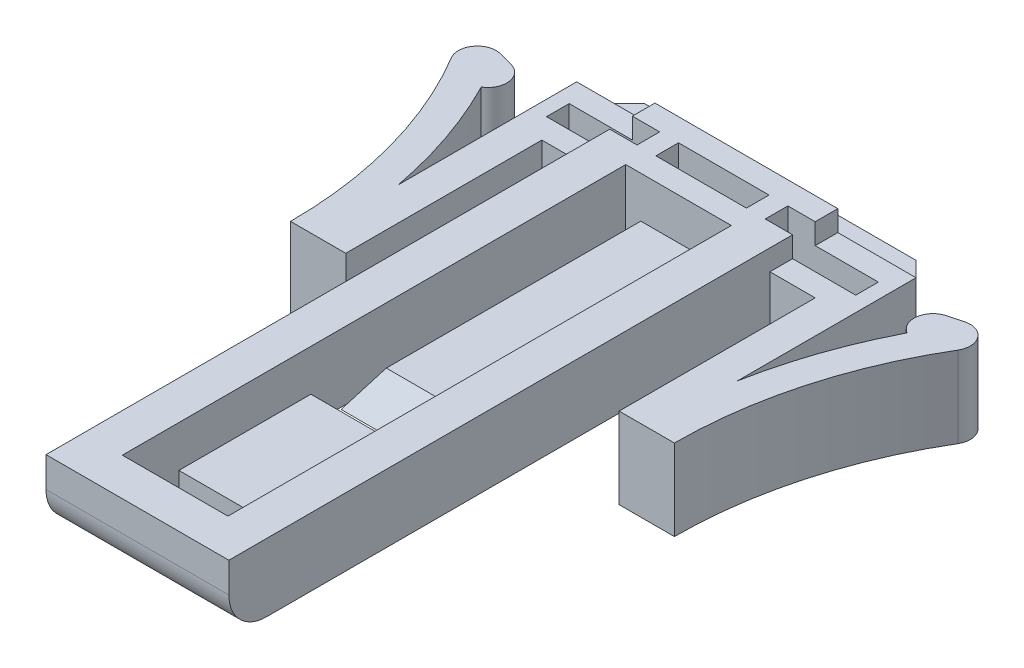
ISO-10303-21;
HEADER;
FILE_DESCRIPTION(('STEP AP214'),'2;1');
FILE_NAME('part.step','',(''),(''),'','','');
FILE_SCHEMA(('AUTOMOTIVE_DESIGN { 1 0 10303 214 1 1 1 1 }'));
ENDSEC;
DATA;
#1=APPLICATION_CONTEXT('core data for automotive mechanical design processes');
#2=APPLICATION_PROTOCOL_DEFINITION('international standard','automotive_design',2000,#1);
#3=PRODUCT_CONTEXT('',#1,'mechanical');
#4=PRODUCT('Part','Part','',(#3));
#5=PRODUCT_RELATED_PRODUCT_CATEGORY('part','',(#4));
#6=PRODUCT_DEFINITION_FORMATION('','',#4);
#7=PRODUCT_DEFINITION_CONTEXT('part definition',#1,'design');
#8=PRODUCT_DEFINITION('design','',#6,#7);
#9=PRODUCT_DEFINITION_SHAPE('','',#8);
#10=(LENGTH_UNIT() NAMED_UNIT(*) SI_UNIT(.MILLI.,.METRE.));
#11=(NAMED_UNIT(*) PLANE_ANGLE_UNIT() SI_UNIT($,.RADIAN.));
#12=(NAMED_UNIT(*) SI_UNIT($,.STERADIAN.) SOLID_ANGLE_UNIT());
#13=UNCERTAINTY_MEASURE_WITH_UNIT(LENGTH_MEASURE(1.E-05),#10,'distance_accuracy_value','');
#14=(GEOMETRIC_REPRESENTATION_CONTEXT(3) GLOBAL_UNCERTAINTY_ASSIGNED_CONTEXT((#13)) GLOBAL_UNIT_ASSIGNED_CONTEXT((#10,
#11,#12)) REPRESENTATION_CONTEXT('',''));
#15=CARTESIAN_POINT('',(0.,0.,0.));
#16=DIRECTION('',(0.,0.,1.));
#17=DIRECTION('',(1.,0.,0.));
#18=AXIS2_PLACEMENT_3D('',#15,#16,#17);
#19=CARTESIAN_POINT('',(0.,0.,0.));
#20=DIRECTION('',(0.,1.,0.));
#21=DIRECTION('',(0.,0.,1.));
#22=AXIS2_PLACEMENT_3D('',#19,#20,#21);
#23=PLANE('',#22);
#24=DIRECTION('',(0.,0.,1.));
#25=VECTOR('',#24,1.);
#26=CARTESIAN_POINT('',(-4.85,0.,0.));
#27=LINE('',#26,#25);
#28=CARTESIAN_POINT('',(-4.85,0.,-12.55));
#29=VERTEX_POINT('',#28);
#30=CARTESIAN_POINT('',(-4.85,0.,14.15));
#31=VERTEX_POINT('',#30);
#32=EDGE_CURVE('E712',#29,#31,#27,.T.);
#33=ORIENTED_EDGE('',*,*,#32,.F.);
#34=DIRECTION('',(1.,0.,0.));
#35=VECTOR('',#34,1.);
#36=CARTESIAN_POINT('',(0.,0.,-12.55));
#37=LINE('',#36,#35);
#38=CARTESIAN_POINT('',(-2.8,0.,-12.55));
#39=VERTEX_POINT('',#38);
#40=EDGE_CURVE('E599',#29,#39,#37,.T.);
#41=ORIENTED_EDGE('',*,*,#40,.T.);
#42=DIRECTION('',(0.,0.,-1.));
#43=VECTOR('',#42,1.);
#44=CARTESIAN_POINT('',(-2.8,0.,0.));
#45=LINE('',#44,#43);
#46=CARTESIAN_POINT('',(-2.8,0.,4.15));
#47=VERTEX_POINT('',#46);
#48=EDGE_CURVE('E719',#47,#39,#45,.T.);
#49=ORIENTED_EDGE('',*,*,#48,.F.);
#50=DIRECTION('',(-1.,0.,0.));
#51=VECTOR('',#50,1.);
#52=CARTESIAN_POINT('',(0.,0.,4.15));
#53=LINE('',#52,#51);
#54=CARTESIAN_POINT('',(2.8,0.,4.15));
#55=VERTEX_POINT('',#54);
#56=EDGE_CURVE('E716',#55,#47,#53,.T.);
#57=ORIENTED_EDGE('',*,*,#56,.F.);
#58=DIRECTION('',(0.,0.,-1.));
#59=VECTOR('',#58,1.);
#60=CARTESIAN_POINT('',(2.8,0.,0.));
#61=LINE('',#60,#59);
#62=CARTESIAN_POINT('',(2.8,0.,-12.55));
#63=VERTEX_POINT('',#62);
#64=EDGE_CURVE('E652',#55,#63,#61,.T.);
#65=ORIENTED_EDGE('',*,*,#64,.T.);
#66=CARTESIAN_POINT('',(4.85,0.,-12.55));
#67=VERTEX_POINT('',#66);
#68=EDGE_CURVE('E594',#63,#67,#37,.T.);
#69=ORIENTED_EDGE('',*,*,#68,.T.);
#70=DIRECTION('',(0.,0.,1.));
#71=VECTOR('',#70,1.);
#72=CARTESIAN_POINT('',(4.85,0.,0.));
#73=LINE('',#72,#71);
#74=CARTESIAN_POINT('',(4.85,0.,14.15));
#75=VERTEX_POINT('',#74);
#76=EDGE_CURVE('E714',#67,#75,#73,.T.);
#77=ORIENTED_EDGE('',*,*,#76,.T.);
#78=DIRECTION('',(-1.,0.,0.));
#79=VECTOR('',#78,1.);
#80=CARTESIAN_POINT('',(-4.85,0.,14.15));
#81=LINE('',#80,#79);
#82=CARTESIAN_POINT('',(2.8,0.,14.15));
#83=VERTEX_POINT('',#82);
#84=EDGE_CURVE('E794',#75,#83,#81,.T.);
#85=ORIENTED_EDGE('',*,*,#84,.T.);
#86=DIRECTION('',(0.,0.,-1.));
#87=VECTOR('',#86,1.);
#88=CARTESIAN_POINT('',(2.8,0.,0.));
#89=LINE('',#88,#87);
#90=CARTESIAN_POINT('',(2.8,0.,11.15));
#91=VERTEX_POINT('',#90);
#92=EDGE_CURVE('E648',#83,#91,#89,.T.);
#93=ORIENTED_EDGE('',*,*,#92,.T.);
#94=DIRECTION('',(1.,0.,0.));
#95=VECTOR('',#94,1.);
#96=CARTESIAN_POINT('',(0.,0.,11.15));
#97=LINE('',#96,#95);
#98=CARTESIAN_POINT('',(-2.8,0.,11.15));
#99=VERTEX_POINT('',#98);
#100=EDGE_CURVE('E709',#99,#91,#97,.T.);
#101=ORIENTED_EDGE('',*,*,#100,.F.);
#102=DIRECTION('',(0.,0.,-1.));
#103=VECTOR('',#102,1.);
#104=CARTESIAN_POINT('',(-2.8,0.,0.));
#105=LINE('',#104,#103);
#106=CARTESIAN_POINT('',(-2.8,0.,14.15));
#107=VERTEX_POINT('',#106);
#108=EDGE_CURVE('E706',#107,#99,#105,.T.);
#109=ORIENTED_EDGE('',*,*,#108,.F.);
#110=DIRECTION('',(-1.,0.,0.));
#111=VECTOR('',#110,1.);
#112=CARTESIAN_POINT('',(-4.85,0.,14.15));
#113=LINE('',#112,#111);
#114=EDGE_CURVE('E745',#107,#31,#113,.T.);
#115=ORIENTED_EDGE('',*,*,#114,.T.);
#116=EDGE_LOOP('',(#33,#41,#49,#57,#65,#69,#77,#85,#93,#101,#109,#115));
#117=FACE_BOUND('',#116,.T.);
#118=ADVANCED_FACE('F37',(#117),#23,.F.);
#119=CARTESIAN_POINT('',(-2.,3.6,0.));
#120=DIRECTION('',(1.,0.,0.));
#121=DIRECTION('',(0.,0.,-1.));
#122=AXIS2_PLACEMENT_3D('',#119,#120,#121);
#123=PLANE('',#122);
#124=DIRECTION('',(0.,-0.28,0.96));
#125=VECTOR('',#124,1.);
#126=CARTESIAN_POINT('',(-2.,1.82784,-0.51688));
#127=LINE('',#126,#125);
#128=CARTESIAN_POINT('',(-2.,1.4,0.950000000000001));
#129=VERTEX_POINT('',#128);
#130=CARTESIAN_POINT('',(-2.,0.7,3.35));
#131=VERTEX_POINT('',#130);
#132=EDGE_CURVE('E609',#129,#131,#127,.T.);
#133=ORIENTED_EDGE('',*,*,#132,.F.);
#134=DIRECTION('',(0.,0.,1.));
#135=VECTOR('',#134,1.);
#136=CARTESIAN_POINT('',(-2.,1.4,0.));
#137=LINE('',#136,#135);
#138=CARTESIAN_POINT('',(-2.,1.4,-12.55));
#139=VERTEX_POINT('',#138);
#140=EDGE_CURVE('E629',#139,#129,#137,.T.);
#141=ORIENTED_EDGE('',*,*,#140,.F.);
#142=DIRECTION('',(0.,-1.,0.));
#143=VECTOR('',#142,1.);
#144=CARTESIAN_POINT('',(-2.,3.6,-12.55));
#145=LINE('',#144,#143);
#146=CARTESIAN_POINT('',(-2.,0.,-12.55));
#147=VERTEX_POINT('',#146);
#148=EDGE_CURVE('E738',#139,#147,#145,.T.);
#149=ORIENTED_EDGE('',*,*,#148,.T.);
#150=DIRECTION('',(0.,0.,1.));
#151=VECTOR('',#150,1.);
#152=CARTESIAN_POINT('',(-2.,0.,0.));
#153=LINE('',#152,#151);
#154=CARTESIAN_POINT('',(-2.,0.,-3.45));
#155=VERTEX_POINT('',#154);
#156=EDGE_CURVE('E722',#147,#155,#153,.T.);
#157=ORIENTED_EDGE('',*,*,#156,.T.);
#158=DIRECTION('',(0.,1.,0.));
#159=VECTOR('',#158,1.);
#160=CARTESIAN_POINT('',(-2.,-1.8,-3.45));
#161=LINE('',#160,#159);
#162=CARTESIAN_POINT('',(-2.,-1.8,-3.45));
#163=VERTEX_POINT('',#162);
#164=EDGE_CURVE('E646',#163,#155,#161,.T.);
#165=ORIENTED_EDGE('',*,*,#164,.F.);
#166=DIRECTION('',(0.,0.,-1.));
#167=VECTOR('',#166,1.);
#168=CARTESIAN_POINT('',(-2.,-1.8,3.35));
#169=LINE('',#168,#167);
#170=CARTESIAN_POINT('',(-2.,-1.8,-0.649999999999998));
#171=VERTEX_POINT('',#170);
#172=EDGE_CURVE('E635',#171,#163,#169,.T.);
#173=ORIENTED_EDGE('',*,*,#172,.F.);
#174=DIRECTION('',(0.,0.52999894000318,0.847998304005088));
#175=VECTOR('',#174,1.);
#176=CARTESIAN_POINT('',(-2.,0.0089887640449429,2.24438202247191));
#177=LINE('',#176,#175);
#178=EDGE_CURVE('E616',#171,#131,#177,.T.);
#179=ORIENTED_EDGE('',*,*,#178,.T.);
#180=EDGE_LOOP('',(#133,#141,#149,#157,#165,#173,#179));
#181=FACE_BOUND('',#180,.T.);
#182=ADVANCED_FACE('F917',(#181),#123,.F.);
#183=CARTESIAN_POINT('',(2.,3.6,0.));
#184=DIRECTION('',(-1.,0.,0.));
#185=DIRECTION('',(0.,0.,1.));
#186=AXIS2_PLACEMENT_3D('',#183,#184,#185);
#187=PLANE('',#186);
#188=DIRECTION('',(0.,0.28,-0.96));
#189=VECTOR('',#188,1.);
#190=CARTESIAN_POINT('',(2.,1.82784,-0.51688));
#191=LINE('',#190,#189);
#192=CARTESIAN_POINT('',(2.,0.7,3.35));
#193=VERTEX_POINT('',#192);
#194=CARTESIAN_POINT('',(2.,1.4,0.950000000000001));
#195=VERTEX_POINT('',#194);
#196=EDGE_CURVE('E607',#193,#195,#191,.T.);
#197=ORIENTED_EDGE('',*,*,#196,.F.);
#198=DIRECTION('',(0.,-0.52999894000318,-0.847998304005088));
#199=VECTOR('',#198,1.);
#200=CARTESIAN_POINT('',(2.,0.0089887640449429,2.24438202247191));
#201=LINE('',#200,#199);
#202=CARTESIAN_POINT('',(2.,-1.8,-0.649999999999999));
#203=VERTEX_POINT('',#202);
#204=EDGE_CURVE('E613',#193,#203,#201,.T.);
#205=ORIENTED_EDGE('',*,*,#204,.T.);
#206=DIRECTION('',(0.,0.,1.));
#207=VECTOR('',#206,1.);
#208=CARTESIAN_POINT('',(2.,-1.8,3.35));
#209=LINE('',#208,#207);
#210=CARTESIAN_POINT('',(2.,-1.8,-3.45));
#211=VERTEX_POINT('',#210);
#212=EDGE_CURVE('E639',#211,#203,#209,.T.);
#213=ORIENTED_EDGE('',*,*,#212,.F.);
#214=DIRECTION('',(0.,1.,0.));
#215=VECTOR('',#214,1.);
#216=CARTESIAN_POINT('',(2.,-1.8,-3.45));
#217=LINE('',#216,#215);
#218=CARTESIAN_POINT('',(2.,0.,-3.45));
#219=VERTEX_POINT('',#218);
#220=EDGE_CURVE('E642',#211,#219,#217,.T.);
#221=ORIENTED_EDGE('',*,*,#220,.T.);
#222=DIRECTION('',(0.,0.,-1.));
#223=VECTOR('',#222,1.);
#224=CARTESIAN_POINT('',(2.,0.,0.));
#225=LINE('',#224,#223);
#226=CARTESIAN_POINT('',(2.,0.,-12.55));
#227=VERTEX_POINT('',#226);
#228=EDGE_CURVE('E725',#219,#227,#225,.T.);
#229=ORIENTED_EDGE('',*,*,#228,.T.);
#230=DIRECTION('',(0.,-1.,0.));
#231=VECTOR('',#230,1.);
#232=CARTESIAN_POINT('',(2.,3.6,-12.55));
#233=LINE('',#232,#231);
#234=CARTESIAN_POINT('',(2.,1.4,-12.55));
#235=VERTEX_POINT('',#234);
#236=EDGE_CURVE('E735',#235,#227,#233,.T.);
#237=ORIENTED_EDGE('',*,*,#236,.F.);
#238=DIRECTION('',(0.,0.,-1.));
#239=VECTOR('',#238,1.);
#240=CARTESIAN_POINT('',(2.,1.4,0.));
#241=LINE('',#240,#239);
#242=EDGE_CURVE('E627',#195,#235,#241,.T.);
#243=ORIENTED_EDGE('',*,*,#242,.F.);
#244=EDGE_LOOP('',(#197,#205,#213,#221,#229,#237,#243));
#245=FACE_BOUND('',#244,.T.);
#246=ADVANCED_FACE('F908',(#245),#187,.F.);
#247=CARTESIAN_POINT('',(0.,1.4,0.));
#248=DIRECTION('',(0.,1.,0.));
#249=DIRECTION('',(0.,0.,1.));
#250=AXIS2_PLACEMENT_3D('',#247,#248,#249);
#251=PLANE('',#250);
#252=ORIENTED_EDGE('',*,*,#140,.T.);
#253=DIRECTION('',(1.,0.,0.));
#254=VECTOR('',#253,1.);
#255=CARTESIAN_POINT('',(-2.25,1.4,0.950000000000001));
#256=LINE('',#255,#254);
#257=EDGE_CURVE('E604',#129,#195,#256,.T.);
#258=ORIENTED_EDGE('',*,*,#257,.T.);
#259=ORIENTED_EDGE('',*,*,#242,.T.);
#260=DIRECTION('',(-1.,0.,0.));
#261=VECTOR('',#260,1.);
#262=CARTESIAN_POINT('',(2.8,1.4,-12.55));
#263=LINE('',#262,#261);
#264=EDGE_CURVE('E621',#235,#139,#263,.T.);
#265=ORIENTED_EDGE('',*,*,#264,.T.);
#266=EDGE_LOOP('',(#252,#258,#259,#265));
#267=FACE_BOUND('',#266,.T.);
#268=ADVANCED_FACE('F921',(#267),#251,.T.);
#269=CARTESIAN_POINT('',(0.,3.6,4.15));
#270=DIRECTION('',(0.,0.,1.));
#271=DIRECTION('',(1.,0.,0.));
#272=AXIS2_PLACEMENT_3D('',#269,#270,#271);
#273=PLANE('',#272);
#274=DIRECTION('',(-1.,0.,0.));
#275=VECTOR('',#274,1.);
#276=CARTESIAN_POINT('',(0.,1.4,4.15));
#277=LINE('',#276,#275);
#278=CARTESIAN_POINT('',(2.8,1.4,4.15));
#279=VERTEX_POINT('',#278);
#280=CARTESIAN_POINT('',(-2.8,1.4,4.15));
#281=VERTEX_POINT('',#280);
#282=EDGE_CURVE('E632',#279,#281,#277,.T.);
#283=ORIENTED_EDGE('',*,*,#282,.F.);
#284=DIRECTION('',(0.,-1.,0.));
#285=VECTOR('',#284,1.);
#286=CARTESIAN_POINT('',(2.8,3.6,4.15));
#287=LINE('',#286,#285);
#288=EDGE_CURVE('E730',#279,#55,#287,.T.);
#289=ORIENTED_EDGE('',*,*,#288,.T.);
#290=ORIENTED_EDGE('',*,*,#56,.T.);
#291=DIRECTION('',(0.,-1.,0.));
#292=VECTOR('',#291,1.);
#293=CARTESIAN_POINT('',(-2.8,3.6,4.15));
#294=LINE('',#293,#292);
#295=EDGE_CURVE('E743',#281,#47,#294,.T.);
#296=ORIENTED_EDGE('',*,*,#295,.F.);
#297=EDGE_LOOP('',(#283,#289,#290,#296));
#298=FACE_BOUND('',#297,.T.);
#299=ADVANCED_FACE('F955',(#298),#273,.F.);
#300=CARTESIAN_POINT('',(0.,3.6,11.15));
#301=DIRECTION('',(0.,0.,-1.));
#302=DIRECTION('',(-1.,0.,0.));
#303=AXIS2_PLACEMENT_3D('',#300,#301,#302);
#304=PLANE('',#303);
#305=DIRECTION('',(1.,0.,0.));
#306=VECTOR('',#305,1.);
#307=CARTESIAN_POINT('',(0.,1.4,11.15));
#308=LINE('',#307,#306);
#309=CARTESIAN_POINT('',(-2.8,1.4,11.15));
#310=VERTEX_POINT('',#309);
#311=CARTESIAN_POINT('',(2.8,1.4,11.15));
#312=VERTEX_POINT('',#311);
#313=EDGE_CURVE('E625',#310,#312,#308,.T.);
#314=ORIENTED_EDGE('',*,*,#313,.F.);
#315=DIRECTION('',(0.,-1.,0.));
#316=VECTOR('',#315,1.);
#317=CARTESIAN_POINT('',(-2.8,3.6,11.15));
#318=LINE('',#317,#316);
#319=EDGE_CURVE('E787',#310,#99,#318,.T.);
#320=ORIENTED_EDGE('',*,*,#319,.T.);
#321=ORIENTED_EDGE('',*,*,#100,.T.);
#322=DIRECTION('',(0.,-1.,0.));
#323=VECTOR('',#322,1.);
#324=CARTESIAN_POINT('',(2.8,3.6,11.15));
#325=LINE('',#324,#323);
#326=EDGE_CURVE('E700',#312,#91,#325,.T.);
#327=ORIENTED_EDGE('',*,*,#326,.F.);
#328=EDGE_LOOP('',(#314,#320,#321,#327));
#329=FACE_BOUND('',#328,.T.);
#330=ADVANCED_FACE('F823',(#329),#304,.F.);
#331=ORIENTED_EDGE('',*,*,#156,.F.);
#332=EDGE_CURVE('E598',#147,#227,#37,.T.);
#333=ORIENTED_EDGE('',*,*,#332,.T.);
#334=ORIENTED_EDGE('',*,*,#228,.F.);
#335=DIRECTION('',(1.,0.,0.));
#336=VECTOR('',#335,1.);
#337=CARTESIAN_POINT('',(-2.,0.,-3.45));
#338=LINE('',#337,#336);
#339=EDGE_CURVE('E634',#155,#219,#338,.T.);
#340=ORIENTED_EDGE('',*,*,#339,.F.);
#341=EDGE_LOOP('',(#331,#333,#334,#340));
#342=FACE_BOUND('',#341,.T.);
#343=ADVANCED_FACE('F900',(#342),#23,.F.);
#344=CARTESIAN_POINT('',(-2.8,3.6,0.));
#345=DIRECTION('',(-1.,0.,0.));
#346=DIRECTION('',(0.,0.,1.));
#347=AXIS2_PLACEMENT_3D('',#344,#345,#346);
#348=PLANE('',#347);
#349=DIRECTION('',(0.,-1.,0.));
#350=VECTOR('',#349,1.);
#351=CARTESIAN_POINT('',(-2.8,3.6,-12.55));
#352=LINE('',#351,#350);
#353=CARTESIAN_POINT('',(-2.8,3.6,-12.55));
#354=VERTEX_POINT('',#353);
#355=EDGE_CURVE('E741',#354,#39,#352,.T.);
#356=ORIENTED_EDGE('',*,*,#355,.F.);
#357=DIRECTION('',(0.,0.,-1.));
#358=VECTOR('',#357,1.);
#359=CARTESIAN_POINT('',(-2.8,3.6,0.));
#360=LINE('',#359,#358);
#361=CARTESIAN_POINT('',(-2.8,3.6,14.15));
#362=VERTEX_POINT('',#361);
#363=EDGE_CURVE('E655',#362,#354,#360,.T.);
#364=ORIENTED_EDGE('',*,*,#363,.F.);
#365=DIRECTION('',(0.,-1.,0.));
#366=VECTOR('',#365,1.);
#367=CARTESIAN_POINT('',(-2.8,3.6,14.15));
#368=LINE('',#367,#366);
#369=EDGE_CURVE('E789',#362,#107,#368,.T.);
#370=ORIENTED_EDGE('',*,*,#369,.T.);
#371=ORIENTED_EDGE('',*,*,#108,.T.);
#372=ORIENTED_EDGE('',*,*,#319,.F.);
#373=DIRECTION('',(0.,0.,1.));
#374=VECTOR('',#373,1.);
#375=CARTESIAN_POINT('',(-2.8,1.4,14.15));
#376=LINE('',#375,#374);
#377=EDGE_CURVE('E623',#281,#310,#376,.T.);
#378=ORIENTED_EDGE('',*,*,#377,.F.);
#379=ORIENTED_EDGE('',*,*,#295,.T.);
#380=ORIENTED_EDGE('',*,*,#48,.T.);
#381=EDGE_LOOP('',(#356,#364,#370,#371,#372,#378,#379,#380));
#382=FACE_BOUND('',#381,.T.);
#383=ADVANCED_FACE('F949',(#382),#348,.F.);
#384=CARTESIAN_POINT('',(0.,3.6,-12.55));
#385=DIRECTION('',(0.,0.,1.));
#386=DIRECTION('',(1.,0.,0.));
#387=AXIS2_PLACEMENT_3D('',#384,#385,#386);
#388=PLANE('',#387);
#389=ORIENTED_EDGE('',*,*,#355,.T.);
#390=ORIENTED_EDGE('',*,*,#40,.F.);
#391=DIRECTION('',(0.,-1.,0.));
#392=VECTOR('',#391,1.);
#393=CARTESIAN_POINT('',(-4.85,3.6,-12.55));
#394=LINE('',#393,#392);
#395=CARTESIAN_POINT('',(-4.85,2.5,-12.55));
#396=VERTEX_POINT('',#395);
#397=EDGE_CURVE('E601',#396,#29,#394,.T.);
#398=ORIENTED_EDGE('',*,*,#397,.F.);
#399=DIRECTION('',(1.,0.,0.));
#400=VECTOR('',#399,1.);
#401=CARTESIAN_POINT('',(0.,2.5,-12.55));
#402=LINE('',#401,#400);
#403=CARTESIAN_POINT('',(-7.25,2.5,-12.55));
#404=VERTEX_POINT('',#403);
#405=EDGE_CURVE('E488',#404,#396,#402,.T.);
#406=ORIENTED_EDGE('',*,*,#405,.F.);
#407=DIRECTION('',(0.,1.,0.));
#408=VECTOR('',#407,1.);
#409=CARTESIAN_POINT('',(-7.25,-1.8,-12.55));
#410=LINE('',#409,#408);
#411=CARTESIAN_POINT('',(-7.25,-1.8,-12.55));
#412=VERTEX_POINT('',#411);
#413=EDGE_CURVE('E570',#412,#404,#410,.T.);
#414=ORIENTED_EDGE('',*,*,#413,.F.);
#415=DIRECTION('',(1.,0.,0.));
#416=VECTOR('',#415,1.);
#417=CARTESIAN_POINT('',(0.,-1.8,-12.55));
#418=LINE('',#417,#416);
#419=CARTESIAN_POINT('',(7.25,-1.8,-12.55));
#420=VERTEX_POINT('',#419);
#421=EDGE_CURVE('E1559',#412,#420,#418,.T.);
#422=ORIENTED_EDGE('',*,*,#421,.T.);
#423=DIRECTION('',(0.,1.,0.));
#424=VECTOR('',#423,1.);
#425=CARTESIAN_POINT('',(7.25,-1.8,-12.55));
#426=LINE('',#425,#424);
#427=CARTESIAN_POINT('',(7.25,2.5,-12.55));
#428=VERTEX_POINT('',#427);
#429=EDGE_CURVE('E567',#420,#428,#426,.T.);
#430=ORIENTED_EDGE('',*,*,#429,.T.);
#431=CARTESIAN_POINT('',(4.85,2.5,-12.55));
#432=VERTEX_POINT('',#431);
#433=EDGE_CURVE('E487',#432,#428,#402,.T.);
#434=ORIENTED_EDGE('',*,*,#433,.F.);
#435=DIRECTION('',(0.,-1.,0.));
#436=VECTOR('',#435,1.);
#437=CARTESIAN_POINT('',(4.85,3.6,-12.55));
#438=LINE('',#437,#436);
#439=EDGE_CURVE('E597',#432,#67,#438,.T.);
#440=ORIENTED_EDGE('',*,*,#439,.T.);
#441=ORIENTED_EDGE('',*,*,#68,.F.);
#442=DIRECTION('',(0.,-1.,0.));
#443=VECTOR('',#442,1.);
#444=CARTESIAN_POINT('',(2.8,3.6,-12.55));
#445=LINE('',#444,#443);
#446=CARTESIAN_POINT('',(2.8,3.6,-12.55));
#447=VERTEX_POINT('',#446);
#448=EDGE_CURVE('E732',#447,#63,#445,.T.);
#449=ORIENTED_EDGE('',*,*,#448,.F.);
#450=DIRECTION('',(-1.,0.,0.));
#451=VECTOR('',#450,1.);
#452=CARTESIAN_POINT('',(0.,3.6,-12.55));
#453=LINE('',#452,#451);
#454=EDGE_CURVE('E697',#447,#354,#453,.T.);
#455=ORIENTED_EDGE('',*,*,#454,.T.);
#456=EDGE_LOOP('',(#389,#390,#398,#406,#414,#422,#430,#434,#440,#441,#449,#455));
#457=FACE_BOUND('',#456,.T.);
#458=ORIENTED_EDGE('',*,*,#332,.F.);
#459=ORIENTED_EDGE('',*,*,#148,.F.);
#460=ORIENTED_EDGE('',*,*,#264,.F.);
#461=ORIENTED_EDGE('',*,*,#236,.T.);
#462=EDGE_LOOP('',(#458,#459,#460,#461));
#463=FACE_BOUND('',#462,.T.);
#464=ADVANCED_FACE('F890',(#457,#463),#388,.T.);
#465=CARTESIAN_POINT('',(0.,3.6,-14.95));
#466=DIRECTION('',(0.,0.,-1.));
#467=DIRECTION('',(-1.,0.,0.));
#468=AXIS2_PLACEMENT_3D('',#465,#466,#467);
#469=PLANE('',#468);
#470=DIRECTION('',(0.,-1.,0.));
#471=VECTOR('',#470,1.);
#472=CARTESIAN_POINT('',(-2.4,3.6,-14.95));
#473=LINE('',#472,#471);
#474=CARTESIAN_POINT('',(-2.4,3.6,-14.95));
#475=VERTEX_POINT('',#474);
#476=CARTESIAN_POINT('',(-2.4,-1.8,-14.95));
#477=VERTEX_POINT('',#476);
#478=EDGE_CURVE('E746',#475,#477,#473,.T.);
#479=ORIENTED_EDGE('',*,*,#478,.T.);
#480=DIRECTION('',(1.,0.,0.));
#481=VECTOR('',#480,1.);
#482=CARTESIAN_POINT('',(0.,-1.8,-14.95));
#483=LINE('',#482,#481);
#484=CARTESIAN_POINT('',(2.4,-1.8,-14.95));
#485=VERTEX_POINT('',#484);
#486=EDGE_CURVE('E444',#477,#485,#483,.T.);
#487=ORIENTED_EDGE('',*,*,#486,.T.);
#488=DIRECTION('',(0.,-1.,0.));
#489=VECTOR('',#488,1.);
#490=CARTESIAN_POINT('',(2.4,3.6,-14.95));
#491=LINE('',#490,#489);
#492=CARTESIAN_POINT('',(2.4,3.6,-14.95));
#493=VERTEX_POINT('',#492);
#494=EDGE_CURVE('E733',#493,#485,#491,.T.);
#495=ORIENTED_EDGE('',*,*,#494,.F.);
#496=DIRECTION('',(1.,0.,0.));
#497=VECTOR('',#496,1.);
#498=CARTESIAN_POINT('',(0.,3.6,-14.95));
#499=LINE('',#498,#497);
#500=EDGE_CURVE('E686',#475,#493,#499,.T.);
#501=ORIENTED_EDGE('',*,*,#500,.F.);
#502=EDGE_LOOP('',(#479,#487,#495,#501));
#503=FACE_BOUND('',#502,.T.);
#504=ADVANCED_FACE('F1366',(#503),#469,.F.);
#505=CARTESIAN_POINT('',(2.4,3.6,0.));
#506=DIRECTION('',(1.,0.,0.));
#507=DIRECTION('',(0.,0.,-1.));
#508=AXIS2_PLACEMENT_3D('',#505,#506,#507);
#509=PLANE('',#508);
#510=ORIENTED_EDGE('',*,*,#494,.T.);
#511=DIRECTION('',(0.,0.,1.));
#512=VECTOR('',#511,1.);
#513=CARTESIAN_POINT('',(2.4,-1.8,0.));
#514=LINE('',#513,#512);
#515=CARTESIAN_POINT('',(2.4,-1.8,-13.75));
#516=VERTEX_POINT('',#515);
#517=EDGE_CURVE('E447',#485,#516,#514,.T.);
#518=ORIENTED_EDGE('',*,*,#517,.T.);
#519=DIRECTION('',(0.,-1.,0.));
#520=VECTOR('',#519,1.);
#521=CARTESIAN_POINT('',(2.4,3.6,-13.75));
#522=LINE('',#521,#520);
#523=CARTESIAN_POINT('',(2.4,3.6,-13.75));
#524=VERTEX_POINT('',#523);
#525=EDGE_CURVE('E751',#524,#516,#522,.T.);
#526=ORIENTED_EDGE('',*,*,#525,.F.);
#527=DIRECTION('',(0.,0.,1.));
#528=VECTOR('',#527,1.);
#529=CARTESIAN_POINT('',(2.4,3.6,0.));
#530=LINE('',#529,#528);
#531=EDGE_CURVE('E689',#493,#524,#530,.T.);
#532=ORIENTED_EDGE('',*,*,#531,.F.);
#533=EDGE_LOOP('',(#510,#518,#526,#532));
#534=FACE_BOUND('',#533,.T.);
#535=ADVANCED_FACE('F1375',(#534),#509,.F.);
#536=CARTESIAN_POINT('',(0.,3.6,-13.75));
#537=DIRECTION('',(0.,0.,-1.));
#538=DIRECTION('',(-1.,0.,0.));
#539=AXIS2_PLACEMENT_3D('',#536,#537,#538);
#540=PLANE('',#539);
#541=ORIENTED_EDGE('',*,*,#525,.T.);
#542=DIRECTION('',(1.,0.,0.));
#543=VECTOR('',#542,1.);
#544=CARTESIAN_POINT('',(0.,-1.8,-13.75));
#545=LINE('',#544,#543);
#546=CARTESIAN_POINT('',(-2.4,-1.8,-13.75));
#547=VERTEX_POINT('',#546);
#548=EDGE_CURVE('E450',#547,#516,#545,.T.);
#549=ORIENTED_EDGE('',*,*,#548,.F.);
#550=DIRECTION('',(0.,-1.,0.));
#551=VECTOR('',#550,1.);
#552=CARTESIAN_POINT('',(-2.4,3.6,-13.75));
#553=LINE('',#552,#551);
#554=CARTESIAN_POINT('',(-2.4,3.6,-13.75));
#555=VERTEX_POINT('',#554);
#556=EDGE_CURVE('E748',#555,#547,#553,.T.);
#557=ORIENTED_EDGE('',*,*,#556,.F.);
#558=DIRECTION('',(1.,0.,0.));
#559=VECTOR('',#558,1.);
#560=CARTESIAN_POINT('',(0.,3.6,-13.75));
#561=LINE('',#560,#559);
#562=EDGE_CURVE('E691',#555,#524,#561,.T.);
#563=ORIENTED_EDGE('',*,*,#562,.T.);
#564=EDGE_LOOP('',(#541,#549,#557,#563));
#565=FACE_BOUND('',#564,.T.);
#566=ADVANCED_FACE('F988',(#565),#540,.T.);
#567=CARTESIAN_POINT('',(-3.4,3.6,0.));
#568=DIRECTION('',(-1.,0.,0.));
#569=DIRECTION('',(0.,0.,1.));
#570=AXIS2_PLACEMENT_3D('',#567,#568,#569);
#571=PLANE('',#570);
#572=DIRECTION('',(0.,-1.,0.));
#573=VECTOR('',#572,1.);
#574=CARTESIAN_POINT('',(-3.4,3.6,-14.95));
#575=LINE('',#574,#573);
#576=CARTESIAN_POINT('',(-3.4,3.6,-14.95));
#577=VERTEX_POINT('',#576);
#578=CARTESIAN_POINT('',(-3.4,-1.8,-14.95));
#579=VERTEX_POINT('',#578);
#580=EDGE_CURVE('E754',#577,#579,#575,.T.);
#581=ORIENTED_EDGE('',*,*,#580,.T.);
#582=DIRECTION('',(0.,0.,1.));
#583=VECTOR('',#582,1.);
#584=CARTESIAN_POINT('',(-3.4,-1.8,0.));
#585=LINE('',#584,#583);
#586=CARTESIAN_POINT('',(-3.4,-1.8,-13.75));
#587=VERTEX_POINT('',#586);
#588=EDGE_CURVE('E460',#579,#587,#585,.T.);
#589=ORIENTED_EDGE('',*,*,#588,.T.);
#590=DIRECTION('',(0.,-1.,0.));
#591=VECTOR('',#590,1.);
#592=CARTESIAN_POINT('',(-3.4,3.6,-13.75));
#593=LINE('',#592,#591);
#594=CARTESIAN_POINT('',(-3.4,3.6,-13.75));
#595=VERTEX_POINT('',#594);
#596=EDGE_CURVE('E749',#595,#587,#593,.T.);
#597=ORIENTED_EDGE('',*,*,#596,.F.);
#598=DIRECTION('',(0.,0.,-1.));
#599=VECTOR('',#598,1.);
#600=CARTESIAN_POINT('',(-3.4,3.6,0.));
#601=LINE('',#600,#599);
#602=EDGE_CURVE('E657',#595,#577,#601,.T.);
#603=ORIENTED_EDGE('',*,*,#602,.T.);
#604=EDGE_LOOP('',(#581,#589,#597,#603));
#605=FACE_BOUND('',#604,.T.);
#606=ADVANCED_FACE('F963',(#605),#571,.T.);
#607=CARTESIAN_POINT('',(0.,3.6,-13.75));
#608=DIRECTION('',(0.,0.,-1.));
#609=DIRECTION('',(-1.,0.,0.));
#610=AXIS2_PLACEMENT_3D('',#607,#608,#609);
#611=PLANE('',#610);
#612=ORIENTED_EDGE('',*,*,#596,.T.);
#613=DIRECTION('',(-1.,0.,0.));
#614=VECTOR('',#613,1.);
#615=CARTESIAN_POINT('',(0.,-1.8,-13.75));
#616=LINE('',#615,#614);
#617=CARTESIAN_POINT('',(-8.2,-1.8,-13.75));
#618=VERTEX_POINT('',#617);
#619=EDGE_CURVE('E463',#587,#618,#616,.T.);
#620=ORIENTED_EDGE('',*,*,#619,.T.);
#621=DIRECTION('',(0.,1.,0.));
#622=VECTOR('',#621,1.);
#623=CARTESIAN_POINT('',(-8.2,-1.8,-13.75));
#624=LINE('',#623,#622);
#625=CARTESIAN_POINT('',(-8.2,2.5,-13.75));
#626=VERTEX_POINT('',#625);
#627=EDGE_CURVE('E533',#618,#626,#624,.T.);
#628=ORIENTED_EDGE('',*,*,#627,.T.);
#629=DIRECTION('',(-1.,0.,0.));
#630=VECTOR('',#629,1.);
#631=CARTESIAN_POINT('',(0.,2.5,-13.75));
#632=LINE('',#631,#630);
#633=CARTESIAN_POINT('',(-4.85,2.5,-13.75));
#634=VERTEX_POINT('',#633);
#635=EDGE_CURVE('E531',#634,#626,#632,.T.);
#636=ORIENTED_EDGE('',*,*,#635,.F.);
#637=DIRECTION('',(0.,-1.,0.));
#638=VECTOR('',#637,1.);
#639=CARTESIAN_POINT('',(-4.85,3.6,-13.75));
#640=LINE('',#639,#638);
#641=CARTESIAN_POINT('',(-4.85,3.6,-13.75));
#642=VERTEX_POINT('',#641);
#643=EDGE_CURVE('E782',#642,#634,#640,.T.);
#644=ORIENTED_EDGE('',*,*,#643,.F.);
#645=DIRECTION('',(1.,0.,0.));
#646=VECTOR('',#645,1.);
#647=CARTESIAN_POINT('',(0.,3.6,-13.75));
#648=LINE('',#647,#646);
#649=EDGE_CURVE('E660',#642,#595,#648,.T.);
#650=ORIENTED_EDGE('',*,*,#649,.T.);
#651=EDGE_LOOP('',(#612,#620,#628,#636,#644,#650));
#652=FACE_BOUND('',#651,.T.);
#653=ADVANCED_FACE('F881',(#652),#611,.T.);
#654=CARTESIAN_POINT('',(-4.85,3.6,0.));
#655=DIRECTION('',(1.,0.,0.));
#656=DIRECTION('',(0.,0.,-1.));
#657=AXIS2_PLACEMENT_3D('',#654,#655,#656);
#658=PLANE('',#657);
#659=DIRECTION('',(0.,0.,1.));
#660=VECTOR('',#659,1.);
#661=CARTESIAN_POINT('',(-4.85,2.5,0.));
#662=LINE('',#661,#660);
#663=EDGE_CURVE('E591',#634,#396,#662,.T.);
#664=ORIENTED_EDGE('',*,*,#663,.T.);
#665=ORIENTED_EDGE('',*,*,#397,.T.);
#666=ORIENTED_EDGE('',*,*,#32,.T.);
#667=CARTESIAN_POINT('',(-4.85,2.,14.15));
#668=DIRECTION('',(1.,0.,0.));
#669=DIRECTION('',(0.,0.,-1.));
#670=AXIS2_PLACEMENT_3D('',#667,#668,#669);
#671=CIRCLE('',#670,2.);
#672=CARTESIAN_POINT('',(-4.85,2.,16.15));
#673=VERTEX_POINT('',#672);
#674=EDGE_CURVE('E797',#31,#673,#671,.F.);
#675=ORIENTED_EDGE('',*,*,#674,.T.);
#676=DIRECTION('',(0.,-1.,0.));
#677=VECTOR('',#676,1.);
#678=CARTESIAN_POINT('',(-4.85,3.6,16.15));
#679=LINE('',#678,#677);
#680=CARTESIAN_POINT('',(-4.85,3.6,16.15));
#681=VERTEX_POINT('',#680);
#682=EDGE_CURVE('E779',#681,#673,#679,.T.);
#683=ORIENTED_EDGE('',*,*,#682,.F.);
#684=DIRECTION('',(0.,0.,1.));
#685=VECTOR('',#684,1.);
#686=CARTESIAN_POINT('',(-4.85,3.6,0.));
#687=LINE('',#686,#685);
#688=EDGE_CURVE('E663',#642,#681,#687,.T.);
#689=ORIENTED_EDGE('',*,*,#688,.F.);
#690=ORIENTED_EDGE('',*,*,#643,.T.);
#691=EDGE_LOOP('',(#664,#665,#666,#675,#683,#689,#690));
#692=FACE_BOUND('',#691,.T.);
#693=ADVANCED_FACE('F833',(#692),#658,.F.);
#694=CARTESIAN_POINT('',(0.,3.6,16.15));
#695=DIRECTION('',(0.,0.,1.));
#696=DIRECTION('',(1.,0.,0.));
#697=AXIS2_PLACEMENT_3D('',#694,#695,#696);
#698=PLANE('',#697);
#699=ORIENTED_EDGE('',*,*,#682,.T.);
#700=DIRECTION('',(-1.,0.,0.));
#701=VECTOR('',#700,1.);
#702=CARTESIAN_POINT('',(4.85,2.,16.15));
#703=LINE('',#702,#701);
#704=CARTESIAN_POINT('',(4.85,2.,16.15));
#705=VERTEX_POINT('',#704);
#706=EDGE_CURVE('E799',#673,#705,#703,.F.);
#707=ORIENTED_EDGE('',*,*,#706,.T.);
#708=DIRECTION('',(0.,-1.,0.));
#709=VECTOR('',#708,1.);
#710=CARTESIAN_POINT('',(4.85,3.6,16.15));
#711=LINE('',#710,#709);
#712=CARTESIAN_POINT('',(4.85,3.6,16.15));
#713=VERTEX_POINT('',#712);
#714=EDGE_CURVE('E776',#713,#705,#711,.T.);
#715=ORIENTED_EDGE('',*,*,#714,.F.);
#716=DIRECTION('',(-1.,0.,0.));
#717=VECTOR('',#716,1.);
#718=CARTESIAN_POINT('',(0.,3.6,16.15));
#719=LINE('',#718,#717);
#720=EDGE_CURVE('E665',#713,#681,#719,.T.);
#721=ORIENTED_EDGE('',*,*,#720,.T.);
#722=EDGE_LOOP('',(#699,#707,#715,#721));
#723=FACE_BOUND('',#722,.T.);
#724=ADVANCED_FACE('F836',(#723),#698,.T.);
#725=CARTESIAN_POINT('',(4.85,3.6,0.));
#726=DIRECTION('',(1.,0.,0.));
#727=DIRECTION('',(0.,0.,-1.));
#728=AXIS2_PLACEMENT_3D('',#725,#726,#727);
#729=PLANE('',#728);
#730=ORIENTED_EDGE('',*,*,#439,.F.);
#731=DIRECTION('',(0.,0.,1.));
#732=VECTOR('',#731,1.);
#733=CARTESIAN_POINT('',(4.85,2.5,0.));
#734=LINE('',#733,#732);
#735=CARTESIAN_POINT('',(4.85,2.5,-13.75));
#736=VERTEX_POINT('',#735);
#737=EDGE_CURVE('E589',#736,#432,#734,.T.);
#738=ORIENTED_EDGE('',*,*,#737,.F.);
#739=DIRECTION('',(0.,-1.,0.));
#740=VECTOR('',#739,1.);
#741=CARTESIAN_POINT('',(4.85,3.6,-13.75));
#742=LINE('',#741,#740);
#743=CARTESIAN_POINT('',(4.85,3.6,-13.75));
#744=VERTEX_POINT('',#743);
#745=EDGE_CURVE('E773',#744,#736,#742,.T.);
#746=ORIENTED_EDGE('',*,*,#745,.F.);
#747=DIRECTION('',(0.,0.,1.));
#748=VECTOR('',#747,1.);
#749=CARTESIAN_POINT('',(4.85,3.6,0.));
#750=LINE('',#749,#748);
#751=EDGE_CURVE('E669',#744,#713,#750,.T.);
#752=ORIENTED_EDGE('',*,*,#751,.T.);
#753=ORIENTED_EDGE('',*,*,#714,.T.);
#754=CARTESIAN_POINT('',(4.85,2.,14.15));
#755=DIRECTION('',(1.,0.,0.));
#756=DIRECTION('',(0.,0.,-1.));
#757=AXIS2_PLACEMENT_3D('',#754,#755,#756);
#758=CIRCLE('',#757,2.);
#759=EDGE_CURVE('E45',#705,#75,#758,.T.);
#760=ORIENTED_EDGE('',*,*,#759,.T.);
#761=ORIENTED_EDGE('',*,*,#76,.F.);
#762=EDGE_LOOP('',(#730,#738,#746,#752,#753,#760,#761));
#763=FACE_BOUND('',#762,.T.);
#764=ADVANCED_FACE('F806',(#763),#729,.T.);
#765=CARTESIAN_POINT('',(0.,3.6,-13.75));
#766=DIRECTION('',(0.,0.,1.));
#767=DIRECTION('',(1.,0.,0.));
#768=AXIS2_PLACEMENT_3D('',#765,#766,#767);
#769=PLANE('',#768);
#770=DIRECTION('',(1.,0.,0.));
#771=VECTOR('',#770,1.);
#772=CARTESIAN_POINT('',(0.,-1.8,-13.75));
#773=LINE('',#772,#771);
#774=CARTESIAN_POINT('',(3.4,-1.8,-13.75));
#775=VERTEX_POINT('',#774);
#776=CARTESIAN_POINT('',(8.2,-1.8,-13.75));
#777=VERTEX_POINT('',#776);
#778=EDGE_CURVE('E439',#775,#777,#773,.T.);
#779=ORIENTED_EDGE('',*,*,#778,.F.);
#780=DIRECTION('',(0.,-1.,0.));
#781=VECTOR('',#780,1.);
#782=CARTESIAN_POINT('',(3.4,3.6,-13.75));
#783=LINE('',#782,#781);
#784=CARTESIAN_POINT('',(3.4,3.6,-13.75));
#785=VERTEX_POINT('',#784);
#786=EDGE_CURVE('E771',#785,#775,#783,.T.);
#787=ORIENTED_EDGE('',*,*,#786,.F.);
#788=DIRECTION('',(-1.,0.,0.));
#789=VECTOR('',#788,1.);
#790=CARTESIAN_POINT('',(0.,3.6,-13.75));
#791=LINE('',#790,#789);
#792=EDGE_CURVE('E672',#744,#785,#791,.T.);
#793=ORIENTED_EDGE('',*,*,#792,.F.);
#794=ORIENTED_EDGE('',*,*,#745,.T.);
#795=DIRECTION('',(1.,0.,0.));
#796=VECTOR('',#795,1.);
#797=CARTESIAN_POINT('',(0.,2.5,-13.75));
#798=LINE('',#797,#796);
#799=CARTESIAN_POINT('',(8.2,2.5,-13.75));
#800=VERTEX_POINT('',#799);
#801=EDGE_CURVE('E524',#736,#800,#798,.T.);
#802=ORIENTED_EDGE('',*,*,#801,.T.);
#803=DIRECTION('',(0.,1.,0.));
#804=VECTOR('',#803,1.);
#805=CARTESIAN_POINT('',(8.2,-1.8,-13.75));
#806=LINE('',#805,#804);
#807=EDGE_CURVE('E540',#777,#800,#806,.T.);
#808=ORIENTED_EDGE('',*,*,#807,.F.);
#809=EDGE_LOOP('',(#779,#787,#793,#794,#802,#808));
#810=FACE_BOUND('',#809,.T.);
#811=ADVANCED_FACE('F849',(#810),#769,.F.);
#812=CARTESIAN_POINT('',(3.4,3.6,0.));
#813=DIRECTION('',(-1.,0.,0.));
#814=DIRECTION('',(0.,0.,1.));
#815=AXIS2_PLACEMENT_3D('',#812,#813,#814);
#816=PLANE('',#815);
#817=ORIENTED_EDGE('',*,*,#786,.T.);
#818=DIRECTION('',(0.,0.,1.));
#819=VECTOR('',#818,1.);
#820=CARTESIAN_POINT('',(3.4,-1.8,0.));
#821=LINE('',#820,#819);
#822=CARTESIAN_POINT('',(3.4,-1.8,-14.95));
#823=VERTEX_POINT('',#822);
#824=EDGE_CURVE('E441',#823,#775,#821,.T.);
#825=ORIENTED_EDGE('',*,*,#824,.F.);
#826=DIRECTION('',(0.,-1.,0.));
#827=VECTOR('',#826,1.);
#828=CARTESIAN_POINT('',(3.4,3.6,-14.95));
#829=LINE('',#828,#827);
#830=CARTESIAN_POINT('',(3.4,3.6,-14.95));
#831=VERTEX_POINT('',#830);
#832=EDGE_CURVE('E769',#831,#823,#829,.T.);
#833=ORIENTED_EDGE('',*,*,#832,.F.);
#834=DIRECTION('',(0.,0.,-1.));
#835=VECTOR('',#834,1.);
#836=CARTESIAN_POINT('',(3.4,3.6,0.));
#837=LINE('',#836,#835);
#838=EDGE_CURVE('E676',#785,#831,#837,.T.);
#839=ORIENTED_EDGE('',*,*,#838,.F.);
#840=EDGE_LOOP('',(#817,#825,#833,#839));
#841=FACE_BOUND('',#840,.T.);
#842=ADVANCED_FACE('F856',(#841),#816,.F.);
#843=CARTESIAN_POINT('',(0.,3.6,-14.95));
#844=DIRECTION('',(0.,0.,1.));
#845=DIRECTION('',(1.,0.,0.));
#846=AXIS2_PLACEMENT_3D('',#843,#844,#845);
#847=PLANE('',#846);
#848=ORIENTED_EDGE('',*,*,#832,.T.);
#849=DIRECTION('',(1.,0.,0.));
#850=VECTOR('',#849,1.);
#851=CARTESIAN_POINT('',(0.,-1.8,-14.95));
#852=LINE('',#851,#850);
#853=CARTESIAN_POINT('',(8.2,-1.8,-14.95));
#854=VERTEX_POINT('',#853);
#855=EDGE_CURVE('E430',#823,#854,#852,.T.);
#856=ORIENTED_EDGE('',*,*,#855,.T.);
#857=DIRECTION('',(0.,1.,0.));
#858=VECTOR('',#857,1.);
#859=CARTESIAN_POINT('',(8.2,-1.8,-14.95));
#860=LINE('',#859,#858);
#861=CARTESIAN_POINT('',(8.2,2.5,-14.95));
#862=VERTEX_POINT('',#861);
#863=EDGE_CURVE('E543',#854,#862,#860,.T.);
#864=ORIENTED_EDGE('',*,*,#863,.T.);
#865=DIRECTION('',(1.,0.,0.));
#866=VECTOR('',#865,1.);
#867=CARTESIAN_POINT('',(0.,2.5,-14.95));
#868=LINE('',#867,#866);
#869=CARTESIAN_POINT('',(4.85,2.5,-14.95));
#870=VERTEX_POINT('',#869);
#871=EDGE_CURVE('E519',#870,#862,#868,.T.);
#872=ORIENTED_EDGE('',*,*,#871,.F.);
#873=DIRECTION('',(0.,-1.,0.));
#874=VECTOR('',#873,1.);
#875=CARTESIAN_POINT('',(4.85,3.6,-14.95));
#876=LINE('',#875,#874);
#877=CARTESIAN_POINT('',(4.85,3.6,-14.95));
#878=VERTEX_POINT('',#877);
#879=EDGE_CURVE('E766',#878,#870,#876,.T.);
#880=ORIENTED_EDGE('',*,*,#879,.F.);
#881=DIRECTION('',(-1.,0.,0.));
#882=VECTOR('',#881,1.);
#883=CARTESIAN_POINT('',(0.,3.6,-14.95));
#884=LINE('',#883,#882);
#885=EDGE_CURVE('E678',#878,#831,#884,.T.);
#886=ORIENTED_EDGE('',*,*,#885,.T.);
#887=EDGE_LOOP('',(#848,#856,#864,#872,#880,#886));
#888=FACE_BOUND('',#887,.T.);
#889=ADVANCED_FACE('F859',(#888),#847,.T.);
#890=DIRECTION('',(0.,0.,1.));
#891=VECTOR('',#890,1.);
#892=CARTESIAN_POINT('',(4.85,2.5,0.));
#893=LINE('',#892,#891);
#894=CARTESIAN_POINT('',(4.85,2.5,-16.15));
#895=VERTEX_POINT('',#894);
#896=EDGE_CURVE('E587',#895,#870,#893,.T.);
#897=ORIENTED_EDGE('',*,*,#896,.F.);
#898=DIRECTION('',(0.,-1.,0.));
#899=VECTOR('',#898,1.);
#900=CARTESIAN_POINT('',(4.85,3.6,-16.15));
#901=LINE('',#900,#899);
#902=CARTESIAN_POINT('',(4.85,3.6,-16.15));
#903=VERTEX_POINT('',#902);
#904=EDGE_CURVE('E763',#903,#895,#901,.T.);
#905=ORIENTED_EDGE('',*,*,#904,.F.);
#906=EDGE_CURVE('E673',#903,#878,#750,.T.);
#907=ORIENTED_EDGE('',*,*,#906,.T.);
#908=ORIENTED_EDGE('',*,*,#879,.T.);
#909=EDGE_LOOP('',(#897,#905,#907,#908));
#910=FACE_BOUND('',#909,.T.);
#911=ADVANCED_FACE('F863',(#910),#729,.T.);
#912=CARTESIAN_POINT('',(0.,3.6,-16.15));
#913=DIRECTION('',(0.,0.,1.));
#914=DIRECTION('',(1.,0.,0.));
#915=AXIS2_PLACEMENT_3D('',#912,#913,#914);
#916=PLANE('',#915);
#917=DIRECTION('',(0.,1.,0.));
#918=VECTOR('',#917,1.);
#919=CARTESIAN_POINT('',(9.,-1.8,-16.15));
#920=LINE('',#919,#918);
#921=CARTESIAN_POINT('',(9.,1.5,-16.15));
#922=VERTEX_POINT('',#921);
#923=CARTESIAN_POINT('',(9.,2.5,-16.15));
#924=VERTEX_POINT('',#923);
#925=EDGE_CURVE('E549',#922,#924,#920,.T.);
#926=ORIENTED_EDGE('',*,*,#925,.F.);
#927=DIRECTION('',(-1.,0.,0.));
#928=VECTOR('',#927,1.);
#929=CARTESIAN_POINT('',(9.00000000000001,1.5,-16.15));
#930=LINE('',#929,#928);
#931=CARTESIAN_POINT('',(-9.,1.5,-16.15));
#932=VERTEX_POINT('',#931);
#933=EDGE_CURVE('E1603',#922,#932,#930,.T.);
#934=ORIENTED_EDGE('',*,*,#933,.T.);
#935=DIRECTION('',(0.,1.,0.));
#936=VECTOR('',#935,1.);
#937=CARTESIAN_POINT('',(-9.,-1.8,-16.15));
#938=LINE('',#937,#936);
#939=CARTESIAN_POINT('',(-9.,2.5,-16.15));
#940=VERTEX_POINT('',#939);
#941=EDGE_CURVE('E416',#932,#940,#938,.T.);
#942=ORIENTED_EDGE('',*,*,#941,.T.);
#943=DIRECTION('',(1.,0.,0.));
#944=VECTOR('',#943,1.);
#945=CARTESIAN_POINT('',(0.,2.5,-16.15));
#946=LINE('',#945,#944);
#947=CARTESIAN_POINT('',(-4.85,2.5,-16.15));
#948=VERTEX_POINT('',#947);
#949=EDGE_CURVE('E514',#940,#948,#946,.T.);
#950=ORIENTED_EDGE('',*,*,#949,.T.);
#951=DIRECTION('',(0.,-1.,0.));
#952=VECTOR('',#951,1.);
#953=CARTESIAN_POINT('',(-4.85,3.6,-16.15));
#954=LINE('',#953,#952);
#955=CARTESIAN_POINT('',(-4.85,3.6,-16.15));
#956=VERTEX_POINT('',#955);
#957=EDGE_CURVE('E760',#956,#948,#954,.T.);
#958=ORIENTED_EDGE('',*,*,#957,.F.);
#959=DIRECTION('',(-1.,0.,0.));
#960=VECTOR('',#959,1.);
#961=CARTESIAN_POINT('',(0.,3.6,-16.15));
#962=LINE('',#961,#960);
#963=EDGE_CURVE('E681',#903,#956,#962,.T.);
#964=ORIENTED_EDGE('',*,*,#963,.F.);
#965=ORIENTED_EDGE('',*,*,#904,.T.);
#966=EDGE_CURVE('E513',#895,#924,#946,.T.);
#967=ORIENTED_EDGE('',*,*,#966,.T.);
#968=EDGE_LOOP('',(#926,#934,#942,#950,#958,#964,#965,#967));
#969=FACE_BOUND('',#968,.T.);
#970=ADVANCED_FACE('F870',(#969),#916,.F.);
#971=ORIENTED_EDGE('',*,*,#957,.T.);
#972=DIRECTION('',(0.,0.,1.));
#973=VECTOR('',#972,1.);
#974=CARTESIAN_POINT('',(-4.85,2.5,0.));
#975=LINE('',#974,#973);
#976=CARTESIAN_POINT('',(-4.85,2.5,-14.95));
#977=VERTEX_POINT('',#976);
#978=EDGE_CURVE('E536',#948,#977,#975,.T.);
#979=ORIENTED_EDGE('',*,*,#978,.T.);
#980=DIRECTION('',(0.,-1.,0.));
#981=VECTOR('',#980,1.);
#982=CARTESIAN_POINT('',(-4.85,3.6,-14.95));
#983=LINE('',#982,#981);
#984=CARTESIAN_POINT('',(-4.85,3.6,-14.95));
#985=VERTEX_POINT('',#984);
#986=EDGE_CURVE('E756',#985,#977,#983,.T.);
#987=ORIENTED_EDGE('',*,*,#986,.F.);
#988=EDGE_CURVE('E666',#956,#985,#687,.T.);
#989=ORIENTED_EDGE('',*,*,#988,.F.);
#990=EDGE_LOOP('',(#971,#979,#987,#989));
#991=FACE_BOUND('',#990,.T.);
#992=ADVANCED_FACE('F873',(#991),#658,.F.);
#993=CARTESIAN_POINT('',(0.,3.6,14.15));
#994=DIRECTION('',(0.,0.,-1.));
#995=DIRECTION('',(-1.,0.,0.));
#996=AXIS2_PLACEMENT_3D('',#993,#994,#995);
#997=PLANE('',#996);
#998=DIRECTION('',(0.,-1.,0.));
#999=VECTOR('',#998,1.);
#1000=CARTESIAN_POINT('',(2.8,3.6,14.15));
#1001=LINE('',#1000,#999);
#1002=CARTESIAN_POINT('',(2.8,3.6,14.15));
#1003=VERTEX_POINT('',#1002);
#1004=EDGE_CURVE('E757',#1003,#83,#1001,.T.);
#1005=ORIENTED_EDGE('',*,*,#1004,.T.);
#1006=DIRECTION('',(1.,0.,0.));
#1007=VECTOR('',#1006,1.);
#1008=CARTESIAN_POINT('',(0.,0.,14.15));
#1009=LINE('',#1008,#1007);
#1010=EDGE_CURVE('E703',#107,#83,#1009,.T.);
#1011=ORIENTED_EDGE('',*,*,#1010,.F.);
#1012=ORIENTED_EDGE('',*,*,#369,.F.);
#1013=DIRECTION('',(1.,0.,0.));
#1014=VECTOR('',#1013,1.);
#1015=CARTESIAN_POINT('',(0.,3.6,14.15));
#1016=LINE('',#1015,#1014);
#1017=EDGE_CURVE('E651',#362,#1003,#1016,.T.);
#1018=ORIENTED_EDGE('',*,*,#1017,.T.);
#1019=EDGE_LOOP('',(#1005,#1011,#1012,#1018));
#1020=FACE_BOUND('',#1019,.T.);
#1021=ADVANCED_FACE('F829',(#1020),#997,.T.);
#1022=CARTESIAN_POINT('',(-2.4,3.6,0.));
#1023=DIRECTION('',(1.,0.,0.));
#1024=DIRECTION('',(0.,0.,-1.));
#1025=AXIS2_PLACEMENT_3D('',#1022,#1023,#1024);
#1026=PLANE('',#1025);
#1027=ORIENTED_EDGE('',*,*,#556,.T.);
#1028=DIRECTION('',(0.,0.,1.));
#1029=VECTOR('',#1028,1.);
#1030=CARTESIAN_POINT('',(-2.4,-1.8,0.));
#1031=LINE('',#1030,#1029);
#1032=EDGE_CURVE('E453',#477,#547,#1031,.T.);
#1033=ORIENTED_EDGE('',*,*,#1032,.F.);
#1034=ORIENTED_EDGE('',*,*,#478,.F.);
#1035=DIRECTION('',(0.,0.,1.));
#1036=VECTOR('',#1035,1.);
#1037=CARTESIAN_POINT('',(-2.4,3.6,0.));
#1038=LINE('',#1037,#1036);
#1039=EDGE_CURVE('E694',#475,#555,#1038,.T.);
#1040=ORIENTED_EDGE('',*,*,#1039,.T.);
#1041=EDGE_LOOP('',(#1027,#1033,#1034,#1040));
#1042=FACE_BOUND('',#1041,.T.);
#1043=ADVANCED_FACE('F966',(#1042),#1026,.T.);
#1044=CARTESIAN_POINT('',(0.,3.6,-14.95));
#1045=DIRECTION('',(0.,0.,-1.));
#1046=DIRECTION('',(-1.,0.,0.));
#1047=AXIS2_PLACEMENT_3D('',#1044,#1045,#1046);
#1048=PLANE('',#1047);
#1049=DIRECTION('',(-1.,0.,0.));
#1050=VECTOR('',#1049,1.);
#1051=CARTESIAN_POINT('',(0.,-1.8,-14.95));
#1052=LINE('',#1051,#1050);
#1053=CARTESIAN_POINT('',(-8.2,-1.8,-14.95));
#1054=VERTEX_POINT('',#1053);
#1055=EDGE_CURVE('E458',#579,#1054,#1052,.T.);
#1056=ORIENTED_EDGE('',*,*,#1055,.F.);
#1057=ORIENTED_EDGE('',*,*,#580,.F.);
#1058=DIRECTION('',(1.,0.,0.));
#1059=VECTOR('',#1058,1.);
#1060=CARTESIAN_POINT('',(0.,3.6,-14.95));
#1061=LINE('',#1060,#1059);
#1062=EDGE_CURVE('E684',#985,#577,#1061,.T.);
#1063=ORIENTED_EDGE('',*,*,#1062,.F.);
#1064=ORIENTED_EDGE('',*,*,#986,.T.);
#1065=DIRECTION('',(-1.,0.,0.));
#1066=VECTOR('',#1065,1.);
#1067=CARTESIAN_POINT('',(0.,2.5,-14.95));
#1068=LINE('',#1067,#1066);
#1069=CARTESIAN_POINT('',(-8.2,2.5,-14.95));
#1070=VERTEX_POINT('',#1069);
#1071=EDGE_CURVE('E529',#977,#1070,#1068,.T.);
#1072=ORIENTED_EDGE('',*,*,#1071,.T.);
#1073=DIRECTION('',(0.,1.,0.));
#1074=VECTOR('',#1073,1.);
#1075=CARTESIAN_POINT('',(-8.2,-1.8,-14.95));
#1076=LINE('',#1075,#1074);
#1077=EDGE_CURVE('E537',#1054,#1070,#1076,.T.);
#1078=ORIENTED_EDGE('',*,*,#1077,.F.);
#1079=EDGE_LOOP('',(#1056,#1057,#1063,#1064,#1072,#1078));
#1080=FACE_BOUND('',#1079,.T.);
#1081=ADVANCED_FACE('F876',(#1080),#1048,.F.);
#1082=CARTESIAN_POINT('',(2.8,3.6,0.));
#1083=DIRECTION('',(-1.,0.,0.));
#1084=DIRECTION('',(0.,0.,1.));
#1085=AXIS2_PLACEMENT_3D('',#1082,#1083,#1084);
#1086=PLANE('',#1085);
#1087=ORIENTED_EDGE('',*,*,#448,.T.);
#1088=ORIENTED_EDGE('',*,*,#64,.F.);
#1089=ORIENTED_EDGE('',*,*,#288,.F.);
#1090=DIRECTION('',(0.,0.,-1.));
#1091=VECTOR('',#1090,1.);
#1092=CARTESIAN_POINT('',(2.8,1.4,14.15));
#1093=LINE('',#1092,#1091);
#1094=EDGE_CURVE('E619',#312,#279,#1093,.T.);
#1095=ORIENTED_EDGE('',*,*,#1094,.F.);
#1096=ORIENTED_EDGE('',*,*,#326,.T.);
#1097=ORIENTED_EDGE('',*,*,#92,.F.);
#1098=ORIENTED_EDGE('',*,*,#1004,.F.);
#1099=DIRECTION('',(0.,0.,-1.));
#1100=VECTOR('',#1099,1.);
#1101=CARTESIAN_POINT('',(2.8,3.6,0.));
#1102=LINE('',#1101,#1100);
#1103=EDGE_CURVE('E649',#1003,#447,#1102,.T.);
#1104=ORIENTED_EDGE('',*,*,#1103,.T.);
#1105=EDGE_LOOP('',(#1087,#1088,#1089,#1095,#1096,#1097,#1098,#1104));
#1106=FACE_BOUND('',#1105,.T.);
#1107=ADVANCED_FACE('F816',(#1106),#1086,.T.);
#1108=CARTESIAN_POINT('',(0.,3.6,0.));
#1109=DIRECTION('',(0.,1.,0.));
#1110=DIRECTION('',(0.,0.,1.));
#1111=AXIS2_PLACEMENT_3D('',#1108,#1109,#1110);
#1112=PLANE('',#1111);
#1113=ORIENTED_EDGE('',*,*,#454,.F.);
#1114=ORIENTED_EDGE('',*,*,#1103,.F.);
#1115=ORIENTED_EDGE('',*,*,#1017,.F.);
#1116=ORIENTED_EDGE('',*,*,#363,.T.);
#1117=EDGE_LOOP('',(#1113,#1114,#1115,#1116));
#1118=FACE_BOUND('',#1117,.T.);
#1119=ORIENTED_EDGE('',*,*,#602,.F.);
#1120=ORIENTED_EDGE('',*,*,#649,.F.);
#1121=ORIENTED_EDGE('',*,*,#688,.T.);
#1122=ORIENTED_EDGE('',*,*,#720,.F.);
#1123=ORIENTED_EDGE('',*,*,#751,.F.);
#1124=ORIENTED_EDGE('',*,*,#792,.T.);
#1125=ORIENTED_EDGE('',*,*,#838,.T.);
#1126=ORIENTED_EDGE('',*,*,#885,.F.);
#1127=ORIENTED_EDGE('',*,*,#906,.F.);
#1128=ORIENTED_EDGE('',*,*,#963,.T.);
#1129=ORIENTED_EDGE('',*,*,#988,.T.);
#1130=ORIENTED_EDGE('',*,*,#1062,.T.);
#1131=EDGE_LOOP('',(#1119,#1120,#1121,#1122,#1123,#1124,#1125,#1126,#1127,#1128,#1129,#1130));
#1132=FACE_BOUND('',#1131,.T.);
#1133=ORIENTED_EDGE('',*,*,#500,.T.);
#1134=ORIENTED_EDGE('',*,*,#531,.T.);
#1135=ORIENTED_EDGE('',*,*,#562,.F.);
#1136=ORIENTED_EDGE('',*,*,#1039,.F.);
#1137=EDGE_LOOP('',(#1133,#1134,#1135,#1136));
#1138=FACE_BOUND('',#1137,.T.);
#1139=ADVANCED_FACE('F841',(#1118,#1132,#1138),#1112,.T.);
#1140=CARTESIAN_POINT('',(0.,2.,14.15));
#1141=DIRECTION('',(1.,0.,0.));
#1142=DIRECTION('',(0.,0.,-1.));
#1143=AXIS2_PLACEMENT_3D('',#1140,#1141,#1142);
#1144=CYLINDRICAL_SURFACE('',#1143,2.);
#1145=ORIENTED_EDGE('',*,*,#759,.F.);
#1146=ORIENTED_EDGE('',*,*,#706,.F.);
#1147=ORIENTED_EDGE('',*,*,#674,.F.);
#1148=ORIENTED_EDGE('',*,*,#114,.F.);
#1149=ORIENTED_EDGE('',*,*,#1010,.T.);
#1150=ORIENTED_EDGE('',*,*,#84,.F.);
#1151=EDGE_LOOP('',(#1145,#1146,#1147,#1148,#1149,#1150));
#1152=FACE_BOUND('',#1151,.T.);
#1153=ADVANCED_FACE('F39',(#1152),#1144,.T.);
#1154=CARTESIAN_POINT('',(-2.,-1.8,-3.45));
#1155=DIRECTION('',(0.,0.,1.));
#1156=DIRECTION('',(1.,0.,0.));
#1157=AXIS2_PLACEMENT_3D('',#1154,#1155,#1156);
#1158=PLANE('',#1157);
#1159=ORIENTED_EDGE('',*,*,#339,.T.);
#1160=ORIENTED_EDGE('',*,*,#220,.F.);
#1161=DIRECTION('',(1.,0.,0.));
#1162=VECTOR('',#1161,1.);
#1163=CARTESIAN_POINT('',(-2.,-1.8,-3.45));
#1164=LINE('',#1163,#1162);
#1165=EDGE_CURVE('E637',#163,#211,#1164,.T.);
#1166=ORIENTED_EDGE('',*,*,#1165,.F.);
#1167=ORIENTED_EDGE('',*,*,#164,.T.);
#1168=EDGE_LOOP('',(#1159,#1160,#1166,#1167));
#1169=FACE_BOUND('',#1168,.T.);
#1170=ADVANCED_FACE('F913',(#1169),#1158,.F.);
#1171=CARTESIAN_POINT('',(0.,-1.8,0.));
#1172=DIRECTION('',(0.,-1.,0.));
#1173=DIRECTION('',(0.,0.,-1.));
#1174=AXIS2_PLACEMENT_3D('',#1171,#1172,#1173);
#1175=PLANE('',#1174);
#1176=DIRECTION('',(1.,0.,0.));
#1177=VECTOR('',#1176,1.);
#1178=CARTESIAN_POINT('',(0.,-1.8,-0.649999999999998));
#1179=LINE('',#1178,#1177);
#1180=EDGE_CURVE('E11',#171,#203,#1179,.T.);
#1181=ORIENTED_EDGE('',*,*,#1180,.F.);
#1182=ORIENTED_EDGE('',*,*,#172,.T.);
#1183=ORIENTED_EDGE('',*,*,#1165,.T.);
#1184=ORIENTED_EDGE('',*,*,#212,.T.);
#1185=EDGE_LOOP('',(#1181,#1182,#1183,#1184));
#1186=FACE_BOUND('',#1185,.T.);
#1187=ADVANCED_FACE('F929',(#1186),#1175,.T.);
#1188=ORIENTED_EDGE('',*,*,#282,.T.);
#1189=ORIENTED_EDGE('',*,*,#377,.T.);
#1190=ORIENTED_EDGE('',*,*,#313,.T.);
#1191=ORIENTED_EDGE('',*,*,#1094,.T.);
#1192=EDGE_LOOP('',(#1188,#1189,#1190,#1191));
#1193=FACE_BOUND('',#1192,.T.);
#1194=ADVANCED_FACE('F931',(#1193),#251,.T.);
#1195=CARTESIAN_POINT('',(-2.25,-1.00224719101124,0.626404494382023));
#1196=DIRECTION('',(0.,0.847998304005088,-0.52999894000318));
#1197=DIRECTION('',(0.,0.52999894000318,0.847998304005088));
#1198=AXIS2_PLACEMENT_3D('',#1195,#1196,#1197);
#1199=PLANE('',#1198);
#1200=ORIENTED_EDGE('',*,*,#1180,.T.);
#1201=ORIENTED_EDGE('',*,*,#204,.F.);
#1202=DIRECTION('',(1.,0.,0.));
#1203=VECTOR('',#1202,1.);
#1204=CARTESIAN_POINT('',(-2.25,0.7,3.35));
#1205=LINE('',#1204,#1203);
#1206=EDGE_CURVE('E611',#131,#193,#1205,.T.);
#1207=ORIENTED_EDGE('',*,*,#1206,.F.);
#1208=ORIENTED_EDGE('',*,*,#178,.F.);
#1209=EDGE_LOOP('',(#1200,#1201,#1207,#1208));
#1210=FACE_BOUND('',#1209,.T.);
#1211=ADVANCED_FACE('F926',(#1210),#1199,.F.);
#1212=CARTESIAN_POINT('',(-2.25,1.5456,0.4508));
#1213=DIRECTION('',(0.,0.96,0.28));
#1214=DIRECTION('',(0.,-0.28,0.96));
#1215=AXIS2_PLACEMENT_3D('',#1212,#1213,#1214);
#1216=PLANE('',#1215);
#1217=ORIENTED_EDGE('',*,*,#132,.T.);
#1218=ORIENTED_EDGE('',*,*,#1206,.T.);
#1219=ORIENTED_EDGE('',*,*,#196,.T.);
#1220=ORIENTED_EDGE('',*,*,#257,.F.);
#1221=EDGE_LOOP('',(#1217,#1218,#1219,#1220));
#1222=FACE_BOUND('',#1221,.T.);
#1223=ADVANCED_FACE('F1065',(#1222),#1216,.T.);
#1224=CARTESIAN_POINT('',(0.,2.5,0.));
#1225=DIRECTION('',(0.,1.,0.));
#1226=DIRECTION('',(0.,0.,1.));
#1227=AXIS2_PLACEMENT_3D('',#1224,#1225,#1226);
#1228=PLANE('',#1227);
#1229=ORIENTED_EDGE('',*,*,#663,.F.);
#1230=ORIENTED_EDGE('',*,*,#635,.T.);
#1231=DIRECTION('',(0.,0.,1.));
#1232=VECTOR('',#1231,1.);
#1233=CARTESIAN_POINT('',(-8.2,2.5,0.));
#1234=LINE('',#1233,#1232);
#1235=EDGE_CURVE('E526',#1070,#626,#1234,.T.);
#1236=ORIENTED_EDGE('',*,*,#1235,.F.);
#1237=ORIENTED_EDGE('',*,*,#1071,.F.);
#1238=ORIENTED_EDGE('',*,*,#978,.F.);
#1239=ORIENTED_EDGE('',*,*,#949,.F.);
#1240=DIRECTION('',(0.,0.,-1.));
#1241=VECTOR('',#1240,1.);
#1242=CARTESIAN_POINT('',(-9.,2.5,0.));
#1243=LINE('',#1242,#1241);
#1244=CARTESIAN_POINT('',(-9.,2.5,-6.66972560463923));
#1245=VERTEX_POINT('',#1244);
#1246=EDGE_CURVE('E517',#1245,#940,#1243,.T.);
#1247=ORIENTED_EDGE('',*,*,#1246,.F.);
#1248=CARTESIAN_POINT('',(-33.181234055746,2.5,-2.15));
#1249=DIRECTION('',(0.,1.,0.));
#1250=DIRECTION('',(0.,0.,1.));
#1251=AXIS2_PLACEMENT_3D('',#1248,#1249,#1250);
#1252=CIRCLE('',#1251,24.6);
#1253=CARTESIAN_POINT('',(-11.2942309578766,2.5,-13.3802758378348));
#1254=VERTEX_POINT('',#1253);
#1255=EDGE_CURVE('E467',#1245,#1254,#1252,.T.);
#1256=ORIENTED_EDGE('',*,*,#1255,.T.);
#1257=CARTESIAN_POINT('',(-11.8,2.5,-14.242944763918));
#1258=DIRECTION('',(0.,1.,0.));
#1259=DIRECTION('',(0.,0.,1.));
#1260=AXIS2_PLACEMENT_3D('',#1257,#1258,#1259);
#1261=CIRCLE('',#1260,1.);
#1262=CARTESIAN_POINT('',(-11.5411809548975,2.5,-15.2088705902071));
#1263=VERTEX_POINT('',#1262);
#1264=EDGE_CURVE('E470',#1254,#1263,#1261,.T.);
#1265=ORIENTED_EDGE('',*,*,#1264,.T.);
#1266=DIRECTION('',(0.96592582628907,0.,0.258819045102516));
#1267=VECTOR('',#1266,1.);
#1268=CARTESIAN_POINT('',(3.02910511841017,2.5,-11.3047742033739));
#1269=LINE('',#1268,#1267);
#1270=CARTESIAN_POINT('',(-12.3139216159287,2.5,-15.4159258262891));
#1271=VERTEX_POINT('',#1270);
#1272=EDGE_CURVE('E474',#1271,#1263,#1269,.T.);
#1273=ORIENTED_EDGE('',*,*,#1272,.F.);
#1274=CARTESIAN_POINT('',(-12.5727406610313,2.5,-14.45));
#1275=DIRECTION('',(0.,1.,0.));
#1276=DIRECTION('',(0.,0.,1.));
#1277=AXIS2_PLACEMENT_3D('',#1274,#1275,#1276);
#1278=CIRCLE('',#1277,1.);
#1279=CARTESIAN_POINT('',(-13.431427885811,2.5,-13.9375));
#1280=VERTEX_POINT('',#1279);
#1281=EDGE_CURVE('E477',#1271,#1280,#1278,.T.);
#1282=ORIENTED_EDGE('',*,*,#1281,.T.);
#1283=CARTESIAN_POINT('',(-33.181234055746,2.5,-2.15));
#1284=DIRECTION('',(0.,1.,0.));
#1285=DIRECTION('',(0.,0.,1.));
#1286=AXIS2_PLACEMENT_3D('',#1283,#1284,#1285);
#1287=CIRCLE('',#1286,23.);
#1288=CARTESIAN_POINT('',(-10.181234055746,2.5,-2.15));
#1289=VERTEX_POINT('',#1288);
#1290=EDGE_CURVE('E480',#1289,#1280,#1287,.T.);
#1291=ORIENTED_EDGE('',*,*,#1290,.F.);
#1292=DIRECTION('',(-1.,0.,0.));
#1293=VECTOR('',#1292,1.);
#1294=CARTESIAN_POINT('',(0.,2.5,-2.15));
#1295=LINE('',#1294,#1293);
#1296=CARTESIAN_POINT('',(-7.25,2.5,-2.15));
#1297=VERTEX_POINT('',#1296);
#1298=EDGE_CURVE('E483',#1297,#1289,#1295,.T.);
#1299=ORIENTED_EDGE('',*,*,#1298,.F.);
#1300=DIRECTION('',(0.,0.,1.));
#1301=VECTOR('',#1300,1.);
#1302=CARTESIAN_POINT('',(-7.25,2.5,0.));
#1303=LINE('',#1302,#1301);
#1304=EDGE_CURVE('E485',#404,#1297,#1303,.T.);
#1305=ORIENTED_EDGE('',*,*,#1304,.F.);
#1306=ORIENTED_EDGE('',*,*,#405,.T.);
#1307=EDGE_LOOP('',(#1229,#1230,#1236,#1237,#1238,#1239,#1247,#1256,#1265,#1273,#1282,#1291,
#1299,#1305,#1306));
#1308=FACE_BOUND('',#1307,.T.);
#1309=ADVANCED_FACE('F884',(#1308),#1228,.T.);
#1310=CARTESIAN_POINT('',(-8.2,-1.8,0.));
#1311=DIRECTION('',(-1.,0.,0.));
#1312=DIRECTION('',(0.,0.,1.));
#1313=AXIS2_PLACEMENT_3D('',#1310,#1311,#1312);
#1314=PLANE('',#1313);
#1315=ORIENTED_EDGE('',*,*,#1235,.T.);
#1316=ORIENTED_EDGE('',*,*,#627,.F.);
#1317=DIRECTION('',(0.,0.,1.));
#1318=VECTOR('',#1317,1.);
#1319=CARTESIAN_POINT('',(-8.2,-1.8,0.));
#1320=LINE('',#1319,#1318);
#1321=EDGE_CURVE('E456',#1054,#618,#1320,.T.);
#1322=ORIENTED_EDGE('',*,*,#1321,.F.);
#1323=ORIENTED_EDGE('',*,*,#1077,.T.);
#1324=EDGE_LOOP('',(#1315,#1316,#1322,#1323));
#1325=FACE_BOUND('',#1324,.T.);
#1326=ADVANCED_FACE('F1064',(#1325),#1314,.F.);
#1327=CARTESIAN_POINT('',(-33.181234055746,-1.8,-2.15));
#1328=DIRECTION('',(0.,1.,0.));
#1329=DIRECTION('',(0.,0.,1.));
#1330=AXIS2_PLACEMENT_3D('',#1327,#1328,#1329);
#1331=CYLINDRICAL_SURFACE('',#1330,24.6);
#1332=ORIENTED_EDGE('',*,*,#1255,.F.);
#1333=DIRECTION('',(0.,1.,0.));
#1334=VECTOR('',#1333,1.);
#1335=CARTESIAN_POINT('',(-9.,-1.8,-6.66972560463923));
#1336=LINE('',#1335,#1334);
#1337=CARTESIAN_POINT('',(-9.,-1.8,-6.66972560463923));
#1338=VERTEX_POINT('',#1337);
#1339=EDGE_CURVE('E546',#1338,#1245,#1336,.T.);
#1340=ORIENTED_EDGE('',*,*,#1339,.F.);
#1341=CARTESIAN_POINT('',(-33.181234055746,-1.8,-2.15));
#1342=DIRECTION('',(0.,1.,0.));
#1343=DIRECTION('',(0.,0.,1.));
#1344=AXIS2_PLACEMENT_3D('',#1341,#1342,#1343);
#1345=CIRCLE('',#1344,24.6);
#1346=CARTESIAN_POINT('',(-11.2942309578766,-1.8,-13.3802758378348));
#1347=VERTEX_POINT('',#1346);
#1348=EDGE_CURVE('E429',#1338,#1347,#1345,.T.);
#1349=ORIENTED_EDGE('',*,*,#1348,.T.);
#1350=DIRECTION('',(0.,1.,0.));
#1351=VECTOR('',#1350,1.);
#1352=CARTESIAN_POINT('',(-11.2942309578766,-1.8,-13.3802758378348));
#1353=LINE('',#1352,#1351);
#1354=EDGE_CURVE('E466',#1347,#1254,#1353,.T.);
#1355=ORIENTED_EDGE('',*,*,#1354,.T.);
#1356=EDGE_LOOP('',(#1332,#1340,#1349,#1355));
#1357=FACE_BOUND('',#1356,.T.);
#1358=ADVANCED_FACE('F1077',(#1357),#1331,.T.);
#1359=CARTESIAN_POINT('',(-9.,-1.8,0.));
#1360=DIRECTION('',(1.,0.,0.));
#1361=DIRECTION('',(0.,0.,-1.));
#1362=AXIS2_PLACEMENT_3D('',#1359,#1360,#1361);
#1363=PLANE('',#1362);
#1364=ORIENTED_EDGE('',*,*,#941,.F.);
#1365=DIRECTION('',(0.,1.,0.));
#1366=VECTOR('',#1365,1.);
#1367=CARTESIAN_POINT('',(-9.,-1.8,-16.15));
#1368=LINE('',#1367,#1366);
#1369=CARTESIAN_POINT('',(-9.,-1.8,-16.15));
#1370=VERTEX_POINT('',#1369);
#1371=EDGE_CURVE('E60',#1370,#932,#1368,.T.);
#1372=ORIENTED_EDGE('',*,*,#1371,.F.);
#1373=DIRECTION('',(0.,0.,-1.));
#1374=VECTOR('',#1373,1.);
#1375=CARTESIAN_POINT('',(-9.,-1.8,0.));
#1376=LINE('',#1375,#1374);
#1377=EDGE_CURVE('E413',#1338,#1370,#1376,.T.);
#1378=ORIENTED_EDGE('',*,*,#1377,.F.);
#1379=ORIENTED_EDGE('',*,*,#1339,.T.);
#1380=ORIENTED_EDGE('',*,*,#1246,.T.);
#1381=EDGE_LOOP('',(#1364,#1372,#1378,#1379,#1380));
#1382=FACE_BOUND('',#1381,.T.);
#1383=ADVANCED_FACE('F411',(#1382),#1363,.F.);
#1384=CARTESIAN_POINT('',(9.,-1.8,0.));
#1385=DIRECTION('',(-1.,0.,0.));
#1386=DIRECTION('',(0.,0.,1.));
#1387=AXIS2_PLACEMENT_3D('',#1384,#1385,#1386);
#1388=PLANE('',#1387);
#1389=DIRECTION('',(0.,0.,1.));
#1390=VECTOR('',#1389,1.);
#1391=CARTESIAN_POINT('',(9.,-1.8,0.));
#1392=LINE('',#1391,#1390);
#1393=CARTESIAN_POINT('',(9.,-1.8,-16.15));
#1394=VERTEX_POINT('',#1393);
#1395=CARTESIAN_POINT('',(9.,-1.8,-6.66972560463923));
#1396=VERTEX_POINT('',#1395);
#1397=EDGE_CURVE('E423',#1394,#1396,#1392,.T.);
#1398=ORIENTED_EDGE('',*,*,#1397,.F.);
#1399=DIRECTION('',(0.,1.,0.));
#1400=VECTOR('',#1399,1.);
#1401=CARTESIAN_POINT('',(9.,-1.8,-16.15));
#1402=LINE('',#1401,#1400);
#1403=EDGE_CURVE('E1604',#1394,#922,#1402,.T.);
#1404=ORIENTED_EDGE('',*,*,#1403,.T.);
#1405=ORIENTED_EDGE('',*,*,#925,.T.);
#1406=DIRECTION('',(0.,0.,1.));
#1407=VECTOR('',#1406,1.);
#1408=CARTESIAN_POINT('',(9.,2.5,0.));
#1409=LINE('',#1408,#1407);
#1410=CARTESIAN_POINT('',(9.,2.5,-6.66972560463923));
#1411=VERTEX_POINT('',#1410);
#1412=EDGE_CURVE('E511',#924,#1411,#1409,.T.);
#1413=ORIENTED_EDGE('',*,*,#1412,.T.);
#1414=DIRECTION('',(0.,1.,0.));
#1415=VECTOR('',#1414,1.);
#1416=CARTESIAN_POINT('',(9.,-1.8,-6.66972560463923));
#1417=LINE('',#1416,#1415);
#1418=EDGE_CURVE('E551',#1396,#1411,#1417,.T.);
#1419=ORIENTED_EDGE('',*,*,#1418,.F.);
#1420=EDGE_LOOP('',(#1398,#1404,#1405,#1413,#1419));
#1421=FACE_BOUND('',#1420,.T.);
#1422=ADVANCED_FACE('F1100',(#1421),#1388,.F.);
#1423=CARTESIAN_POINT('',(33.181234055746,-1.8,-2.15000000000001));
#1424=DIRECTION('',(0.,1.,0.));
#1425=DIRECTION('',(0.,0.,1.));
#1426=AXIS2_PLACEMENT_3D('',#1423,#1424,#1425);
#1427=CYLINDRICAL_SURFACE('',#1426,24.6);
#1428=CARTESIAN_POINT('',(33.181234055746,2.5,-2.15000000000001));
#1429=DIRECTION('',(0.,1.,0.));
#1430=DIRECTION('',(0.,0.,1.));
#1431=AXIS2_PLACEMENT_3D('',#1428,#1429,#1430);
#1432=CIRCLE('',#1431,24.6);
#1433=CARTESIAN_POINT('',(11.2942309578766,2.5,-13.3802758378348));
#1434=VERTEX_POINT('',#1433);
#1435=EDGE_CURVE('E509',#1411,#1434,#1432,.F.);
#1436=ORIENTED_EDGE('',*,*,#1435,.T.);
#1437=DIRECTION('',(0.,1.,0.));
#1438=VECTOR('',#1437,1.);
#1439=CARTESIAN_POINT('',(11.2942309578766,-1.8,-13.3802758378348));
#1440=LINE('',#1439,#1438);
#1441=CARTESIAN_POINT('',(11.2942309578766,-1.8,-13.3802758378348));
#1442=VERTEX_POINT('',#1441);
#1443=EDGE_CURVE('E554',#1442,#1434,#1440,.T.);
#1444=ORIENTED_EDGE('',*,*,#1443,.F.);
#1445=CARTESIAN_POINT('',(33.181234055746,-1.8,-2.15000000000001));
#1446=DIRECTION('',(0.,1.,0.));
#1447=DIRECTION('',(0.,0.,1.));
#1448=AXIS2_PLACEMENT_3D('',#1445,#1446,#1447);
#1449=CIRCLE('',#1448,24.6);
#1450=EDGE_CURVE('E1582',#1396,#1442,#1449,.F.);
#1451=ORIENTED_EDGE('',*,*,#1450,.F.);
#1452=ORIENTED_EDGE('',*,*,#1418,.T.);
#1453=EDGE_LOOP('',(#1436,#1444,#1451,#1452));
#1454=FACE_BOUND('',#1453,.T.);
#1455=ADVANCED_FACE('F1094',(#1454),#1427,.T.);
#1456=CARTESIAN_POINT('',(11.8,-1.8,-14.242944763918));
#1457=DIRECTION('',(0.,1.,0.));
#1458=DIRECTION('',(0.,0.,1.));
#1459=AXIS2_PLACEMENT_3D('',#1456,#1457,#1458);
#1460=CYLINDRICAL_SURFACE('',#1459,1.);
#1461=CARTESIAN_POINT('',(11.8,2.5,-14.242944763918));
#1462=DIRECTION('',(0.,1.,0.));
#1463=DIRECTION('',(0.,0.,1.));
#1464=AXIS2_PLACEMENT_3D('',#1461,#1462,#1463);
#1465=CIRCLE('',#1464,1.);
#1466=CARTESIAN_POINT('',(11.5411809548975,2.5,-15.2088705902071));
#1467=VERTEX_POINT('',#1466);
#1468=EDGE_CURVE('E506',#1434,#1467,#1465,.F.);
#1469=ORIENTED_EDGE('',*,*,#1468,.T.);
#1470=DIRECTION('',(0.,1.,0.));
#1471=VECTOR('',#1470,1.);
#1472=CARTESIAN_POINT('',(11.5411809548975,-1.8,-15.2088705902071));
#1473=LINE('',#1472,#1471);
#1474=CARTESIAN_POINT('',(11.5411809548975,-1.8,-15.2088705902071));
#1475=VERTEX_POINT('',#1474);
#1476=EDGE_CURVE('E557',#1475,#1467,#1473,.T.);
#1477=ORIENTED_EDGE('',*,*,#1476,.F.);
#1478=CARTESIAN_POINT('',(11.8,-1.8,-14.242944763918));
#1479=DIRECTION('',(0.,1.,0.));
#1480=DIRECTION('',(0.,0.,1.));
#1481=AXIS2_PLACEMENT_3D('',#1478,#1479,#1480);
#1482=CIRCLE('',#1481,1.);
#1483=EDGE_CURVE('E1580',#1442,#1475,#1482,.F.);
#1484=ORIENTED_EDGE('',*,*,#1483,.F.);
#1485=ORIENTED_EDGE('',*,*,#1443,.T.);
#1486=EDGE_LOOP('',(#1469,#1477,#1484,#1485));
#1487=FACE_BOUND('',#1486,.T.);
#1488=ADVANCED_FACE('F1099',(#1487),#1460,.T.);
#1489=CARTESIAN_POINT('',(-3.02910511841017,-1.8,-11.3047742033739));
#1490=DIRECTION('',(-0.258819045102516,0.,-0.96592582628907));
#1491=DIRECTION('',(-0.96592582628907,0.,0.258819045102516));
#1492=AXIS2_PLACEMENT_3D('',#1489,#1490,#1491);
#1493=PLANE('',#1492);
#1494=DIRECTION('',(-0.96592582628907,0.,0.258819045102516));
#1495=VECTOR('',#1494,1.);
#1496=CARTESIAN_POINT('',(-3.02910511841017,2.5,-11.3047742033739));
#1497=LINE('',#1496,#1495);
#1498=CARTESIAN_POINT('',(12.3139216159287,2.5,-15.4159258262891));
#1499=VERTEX_POINT('',#1498);
#1500=EDGE_CURVE('E503',#1499,#1467,#1497,.T.);
#1501=ORIENTED_EDGE('',*,*,#1500,.F.);
#1502=DIRECTION('',(0.,1.,0.));
#1503=VECTOR('',#1502,1.);
#1504=CARTESIAN_POINT('',(12.3139216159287,-1.8,-15.4159258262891));
#1505=LINE('',#1504,#1503);
#1506=CARTESIAN_POINT('',(12.3139216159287,-1.8,-15.4159258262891));
#1507=VERTEX_POINT('',#1506);
#1508=EDGE_CURVE('E559',#1507,#1499,#1505,.T.);
#1509=ORIENTED_EDGE('',*,*,#1508,.F.);
#1510=DIRECTION('',(-0.96592582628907,0.,0.258819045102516));
#1511=VECTOR('',#1510,1.);
#1512=CARTESIAN_POINT('',(-3.02910511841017,-1.8,-11.3047742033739));
#1513=LINE('',#1512,#1511);
#1514=EDGE_CURVE('E1577',#1507,#1475,#1513,.T.);
#1515=ORIENTED_EDGE('',*,*,#1514,.T.);
#1516=ORIENTED_EDGE('',*,*,#1476,.T.);
#1517=EDGE_LOOP('',(#1501,#1509,#1515,#1516));
#1518=FACE_BOUND('',#1517,.T.);
#1519=ADVANCED_FACE('F1112',(#1518),#1493,.T.);
#1520=CARTESIAN_POINT('',(12.5727406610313,-1.8,-14.45));
#1521=DIRECTION('',(0.,1.,0.));
#1522=DIRECTION('',(0.,0.,1.));
#1523=AXIS2_PLACEMENT_3D('',#1520,#1521,#1522);
#1524=CYLINDRICAL_SURFACE('',#1523,1.);
#1525=CARTESIAN_POINT('',(12.5727406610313,2.5,-14.45));
#1526=DIRECTION('',(0.,1.,0.));
#1527=DIRECTION('',(0.,0.,1.));
#1528=AXIS2_PLACEMENT_3D('',#1525,#1526,#1527);
#1529=CIRCLE('',#1528,1.);
#1530=CARTESIAN_POINT('',(13.431427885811,2.5,-13.9375));
#1531=VERTEX_POINT('',#1530);
#1532=EDGE_CURVE('E500',#1499,#1531,#1529,.F.);
#1533=ORIENTED_EDGE('',*,*,#1532,.T.);
#1534=DIRECTION('',(0.,1.,0.));
#1535=VECTOR('',#1534,1.);
#1536=CARTESIAN_POINT('',(13.431427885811,-1.8,-13.9375));
#1537=LINE('',#1536,#1535);
#1538=CARTESIAN_POINT('',(13.431427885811,-1.8,-13.9375));
#1539=VERTEX_POINT('',#1538);
#1540=EDGE_CURVE('E561',#1539,#1531,#1537,.T.);
#1541=ORIENTED_EDGE('',*,*,#1540,.F.);
#1542=CARTESIAN_POINT('',(12.5727406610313,-1.8,-14.45));
#1543=DIRECTION('',(0.,1.,0.));
#1544=DIRECTION('',(0.,0.,1.));
#1545=AXIS2_PLACEMENT_3D('',#1542,#1543,#1544);
#1546=CIRCLE('',#1545,1.);
#1547=EDGE_CURVE('E1575',#1507,#1539,#1546,.F.);
#1548=ORIENTED_EDGE('',*,*,#1547,.F.);
#1549=ORIENTED_EDGE('',*,*,#1508,.T.);
#1550=EDGE_LOOP('',(#1533,#1541,#1548,#1549));
#1551=FACE_BOUND('',#1550,.T.);
#1552=ADVANCED_FACE('F1122',(#1551),#1524,.T.);
#1553=CARTESIAN_POINT('',(33.181234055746,-1.8,-2.15000000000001));
#1554=DIRECTION('',(0.,1.,0.));
#1555=DIRECTION('',(0.,0.,1.));
#1556=AXIS2_PLACEMENT_3D('',#1553,#1554,#1555);
#1557=CYLINDRICAL_SURFACE('',#1556,23.);
#1558=CARTESIAN_POINT('',(33.181234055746,2.5,-2.15000000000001));
#1559=DIRECTION('',(0.,1.,0.));
#1560=DIRECTION('',(0.,0.,1.));
#1561=AXIS2_PLACEMENT_3D('',#1558,#1559,#1560);
#1562=CIRCLE('',#1561,23.);
#1563=CARTESIAN_POINT('',(10.181234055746,2.5,-2.15));
#1564=VERTEX_POINT('',#1563);
#1565=EDGE_CURVE('E497',#1564,#1531,#1562,.F.);
#1566=ORIENTED_EDGE('',*,*,#1565,.F.);
#1567=DIRECTION('',(0.,1.,0.));
#1568=VECTOR('',#1567,1.);
#1569=CARTESIAN_POINT('',(10.181234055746,-1.8,-2.15));
#1570=LINE('',#1569,#1568);
#1571=CARTESIAN_POINT('',(10.181234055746,-1.8,-2.15));
#1572=VERTEX_POINT('',#1571);
#1573=EDGE_CURVE('E563',#1572,#1564,#1570,.T.);
#1574=ORIENTED_EDGE('',*,*,#1573,.F.);
#1575=CARTESIAN_POINT('',(33.181234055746,-1.8,-2.15000000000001));
#1576=DIRECTION('',(0.,1.,0.));
#1577=DIRECTION('',(0.,0.,1.));
#1578=AXIS2_PLACEMENT_3D('',#1575,#1576,#1577);
#1579=CIRCLE('',#1578,23.);
#1580=EDGE_CURVE('E1572',#1572,#1539,#1579,.F.);
#1581=ORIENTED_EDGE('',*,*,#1580,.T.);
#1582=ORIENTED_EDGE('',*,*,#1540,.T.);
#1583=EDGE_LOOP('',(#1566,#1574,#1581,#1582));
#1584=FACE_BOUND('',#1583,.T.);
#1585=ADVANCED_FACE('F1132',(#1584),#1557,.F.);
#1586=CARTESIAN_POINT('',(0.,-1.8,-2.15));
#1587=DIRECTION('',(0.,0.,1.));
#1588=DIRECTION('',(1.,0.,0.));
#1589=AXIS2_PLACEMENT_3D('',#1586,#1587,#1588);
#1590=PLANE('',#1589);
#1591=DIRECTION('',(1.,0.,0.));
#1592=VECTOR('',#1591,1.);
#1593=CARTESIAN_POINT('',(0.,2.5,-2.15));
#1594=LINE('',#1593,#1592);
#1595=CARTESIAN_POINT('',(7.25,2.5,-2.15));
#1596=VERTEX_POINT('',#1595);
#1597=EDGE_CURVE('E494',#1596,#1564,#1594,.T.);
#1598=ORIENTED_EDGE('',*,*,#1597,.F.);
#1599=DIRECTION('',(0.,1.,0.));
#1600=VECTOR('',#1599,1.);
#1601=CARTESIAN_POINT('',(7.25,-1.8,-2.15));
#1602=LINE('',#1601,#1600);
#1603=CARTESIAN_POINT('',(7.25,-1.8,-2.15));
#1604=VERTEX_POINT('',#1603);
#1605=EDGE_CURVE('E565',#1604,#1596,#1602,.T.);
#1606=ORIENTED_EDGE('',*,*,#1605,.F.);
#1607=DIRECTION('',(1.,0.,0.));
#1608=VECTOR('',#1607,1.);
#1609=CARTESIAN_POINT('',(0.,-1.8,-2.15));
#1610=LINE('',#1609,#1608);
#1611=EDGE_CURVE('E1566',#1604,#1572,#1610,.T.);
#1612=ORIENTED_EDGE('',*,*,#1611,.T.);
#1613=ORIENTED_EDGE('',*,*,#1573,.T.);
#1614=EDGE_LOOP('',(#1598,#1606,#1612,#1613));
#1615=FACE_BOUND('',#1614,.T.);
#1616=ADVANCED_FACE('F1142',(#1615),#1590,.T.);
#1617=CARTESIAN_POINT('',(7.25,-1.8,0.));
#1618=DIRECTION('',(-1.,0.,0.));
#1619=DIRECTION('',(0.,0.,1.));
#1620=AXIS2_PLACEMENT_3D('',#1617,#1618,#1619);
#1621=PLANE('',#1620);
#1622=DIRECTION('',(0.,0.,1.));
#1623=VECTOR('',#1622,1.);
#1624=CARTESIAN_POINT('',(7.25,2.5,0.));
#1625=LINE('',#1624,#1623);
#1626=EDGE_CURVE('E491',#428,#1596,#1625,.T.);
#1627=ORIENTED_EDGE('',*,*,#1626,.F.);
#1628=ORIENTED_EDGE('',*,*,#429,.F.);
#1629=DIRECTION('',(0.,0.,1.));
#1630=VECTOR('',#1629,1.);
#1631=CARTESIAN_POINT('',(7.25,-1.8,0.));
#1632=LINE('',#1631,#1630);
#1633=EDGE_CURVE('E1564',#420,#1604,#1632,.T.);
#1634=ORIENTED_EDGE('',*,*,#1633,.T.);
#1635=ORIENTED_EDGE('',*,*,#1605,.T.);
#1636=EDGE_LOOP('',(#1627,#1628,#1634,#1635));
#1637=FACE_BOUND('',#1636,.T.);
#1638=ADVANCED_FACE('F1152',(#1637),#1621,.T.);
#1639=CARTESIAN_POINT('',(-7.25,-1.8,0.));
#1640=DIRECTION('',(-1.,0.,0.));
#1641=DIRECTION('',(0.,0.,1.));
#1642=AXIS2_PLACEMENT_3D('',#1639,#1640,#1641);
#1643=PLANE('',#1642);
#1644=ORIENTED_EDGE('',*,*,#1304,.T.);
#1645=DIRECTION('',(0.,1.,0.));
#1646=VECTOR('',#1645,1.);
#1647=CARTESIAN_POINT('',(-7.25,-1.8,-2.15));
#1648=LINE('',#1647,#1646);
#1649=CARTESIAN_POINT('',(-7.25,-1.8,-2.15));
#1650=VERTEX_POINT('',#1649);
#1651=EDGE_CURVE('E572',#1650,#1297,#1648,.T.);
#1652=ORIENTED_EDGE('',*,*,#1651,.F.);
#1653=DIRECTION('',(0.,0.,1.));
#1654=VECTOR('',#1653,1.);
#1655=CARTESIAN_POINT('',(-7.25,-1.8,0.));
#1656=LINE('',#1655,#1654);
#1657=EDGE_CURVE('E1557',#412,#1650,#1656,.T.);
#1658=ORIENTED_EDGE('',*,*,#1657,.F.);
#1659=ORIENTED_EDGE('',*,*,#413,.T.);
#1660=EDGE_LOOP('',(#1644,#1652,#1658,#1659));
#1661=FACE_BOUND('',#1660,.T.);
#1662=ADVANCED_FACE('F1162',(#1661),#1643,.F.);
#1663=CARTESIAN_POINT('',(0.,-1.8,-2.15));
#1664=DIRECTION('',(0.,0.,-1.));
#1665=DIRECTION('',(-1.,0.,0.));
#1666=AXIS2_PLACEMENT_3D('',#1663,#1664,#1665);
#1667=PLANE('',#1666);
#1668=ORIENTED_EDGE('',*,*,#1298,.T.);
#1669=DIRECTION('',(0.,1.,0.));
#1670=VECTOR('',#1669,1.);
#1671=CARTESIAN_POINT('',(-10.181234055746,-1.8,-2.15));
#1672=LINE('',#1671,#1670);
#1673=CARTESIAN_POINT('',(-10.181234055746,-1.8,-2.15));
#1674=VERTEX_POINT('',#1673);
#1675=EDGE_CURVE('E575',#1674,#1289,#1672,.T.);
#1676=ORIENTED_EDGE('',*,*,#1675,.F.);
#1677=DIRECTION('',(-1.,0.,0.));
#1678=VECTOR('',#1677,1.);
#1679=CARTESIAN_POINT('',(0.,-1.8,-2.15));
#1680=LINE('',#1679,#1678);
#1681=EDGE_CURVE('E1556',#1650,#1674,#1680,.T.);
#1682=ORIENTED_EDGE('',*,*,#1681,.F.);
#1683=ORIENTED_EDGE('',*,*,#1651,.T.);
#1684=EDGE_LOOP('',(#1668,#1676,#1682,#1683));
#1685=FACE_BOUND('',#1684,.T.);
#1686=ADVANCED_FACE('F1172',(#1685),#1667,.F.);
#1687=CARTESIAN_POINT('',(-33.181234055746,-1.8,-2.15));
#1688=DIRECTION('',(0.,1.,0.));
#1689=DIRECTION('',(0.,0.,1.));
#1690=AXIS2_PLACEMENT_3D('',#1687,#1688,#1689);
#1691=CYLINDRICAL_SURFACE('',#1690,23.);
#1692=ORIENTED_EDGE('',*,*,#1290,.T.);
#1693=DIRECTION('',(0.,1.,0.));
#1694=VECTOR('',#1693,1.);
#1695=CARTESIAN_POINT('',(-13.431427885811,-1.8,-13.9375));
#1696=LINE('',#1695,#1694);
#1697=CARTESIAN_POINT('',(-13.431427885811,-1.8,-13.9375));
#1698=VERTEX_POINT('',#1697);
#1699=EDGE_CURVE('E578',#1698,#1280,#1696,.T.);
#1700=ORIENTED_EDGE('',*,*,#1699,.F.);
#1701=CARTESIAN_POINT('',(-33.181234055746,-1.8,-2.15));
#1702=DIRECTION('',(0.,1.,0.));
#1703=DIRECTION('',(0.,0.,1.));
#1704=AXIS2_PLACEMENT_3D('',#1701,#1702,#1703);
#1705=CIRCLE('',#1704,23.);
#1706=EDGE_CURVE('E1616',#1674,#1698,#1705,.T.);
#1707=ORIENTED_EDGE('',*,*,#1706,.F.);
#1708=ORIENTED_EDGE('',*,*,#1675,.T.);
#1709=EDGE_LOOP('',(#1692,#1700,#1707,#1708));
#1710=FACE_BOUND('',#1709,.T.);
#1711=ADVANCED_FACE('F1182',(#1710),#1691,.F.);
#1712=CARTESIAN_POINT('',(-12.5727406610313,-1.8,-14.45));
#1713=DIRECTION('',(0.,1.,0.));
#1714=DIRECTION('',(0.,0.,1.));
#1715=AXIS2_PLACEMENT_3D('',#1712,#1713,#1714);
#1716=CYLINDRICAL_SURFACE('',#1715,1.);
#1717=ORIENTED_EDGE('',*,*,#1281,.F.);
#1718=DIRECTION('',(0.,1.,0.));
#1719=VECTOR('',#1718,1.);
#1720=CARTESIAN_POINT('',(-12.3139216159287,-1.8,-15.4159258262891));
#1721=LINE('',#1720,#1719);
#1722=CARTESIAN_POINT('',(-12.3139216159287,-1.8,-15.4159258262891));
#1723=VERTEX_POINT('',#1722);
#1724=EDGE_CURVE('E580',#1723,#1271,#1721,.T.);
#1725=ORIENTED_EDGE('',*,*,#1724,.F.);
#1726=CARTESIAN_POINT('',(-12.5727406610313,-1.8,-14.45));
#1727=DIRECTION('',(0.,1.,0.));
#1728=DIRECTION('',(0.,0.,1.));
#1729=AXIS2_PLACEMENT_3D('',#1726,#1727,#1728);
#1730=CIRCLE('',#1729,1.);
#1731=EDGE_CURVE('E1551',#1723,#1698,#1730,.T.);
#1732=ORIENTED_EDGE('',*,*,#1731,.T.);
#1733=ORIENTED_EDGE('',*,*,#1699,.T.);
#1734=EDGE_LOOP('',(#1717,#1725,#1732,#1733));
#1735=FACE_BOUND('',#1734,.T.);
#1736=ADVANCED_FACE('F1192',(#1735),#1716,.T.);
#1737=CARTESIAN_POINT('',(3.02910511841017,-1.8,-11.3047742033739));
#1738=DIRECTION('',(-0.258819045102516,0.,0.96592582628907));
#1739=DIRECTION('',(0.96592582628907,0.,0.258819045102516));
#1740=AXIS2_PLACEMENT_3D('',#1737,#1738,#1739);
#1741=PLANE('',#1740);
#1742=ORIENTED_EDGE('',*,*,#1272,.T.);
#1743=DIRECTION('',(0.,1.,0.));
#1744=VECTOR('',#1743,1.);
#1745=CARTESIAN_POINT('',(-11.5411809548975,-1.8,-15.2088705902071));
#1746=LINE('',#1745,#1744);
#1747=CARTESIAN_POINT('',(-11.5411809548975,-1.8,-15.2088705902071));
#1748=VERTEX_POINT('',#1747);
#1749=EDGE_CURVE('E582',#1748,#1263,#1746,.T.);
#1750=ORIENTED_EDGE('',*,*,#1749,.F.);
#1751=DIRECTION('',(0.96592582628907,0.,0.258819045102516));
#1752=VECTOR('',#1751,1.);
#1753=CARTESIAN_POINT('',(3.02910511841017,-1.8,-11.3047742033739));
#1754=LINE('',#1753,#1752);
#1755=EDGE_CURVE('E1613',#1723,#1748,#1754,.T.);
#1756=ORIENTED_EDGE('',*,*,#1755,.F.);
#1757=ORIENTED_EDGE('',*,*,#1724,.T.);
#1758=EDGE_LOOP('',(#1742,#1750,#1756,#1757));
#1759=FACE_BOUND('',#1758,.T.);
#1760=ADVANCED_FACE('F1202',(#1759),#1741,.F.);
#1761=CARTESIAN_POINT('',(8.2,-1.8,0.));
#1762=DIRECTION('',(-1.,0.,0.));
#1763=DIRECTION('',(0.,0.,1.));
#1764=AXIS2_PLACEMENT_3D('',#1761,#1762,#1763);
#1765=PLANE('',#1764);
#1766=DIRECTION('',(0.,0.,1.));
#1767=VECTOR('',#1766,1.);
#1768=CARTESIAN_POINT('',(8.2,2.5,0.));
#1769=LINE('',#1768,#1767);
#1770=EDGE_CURVE('E521',#862,#800,#1769,.T.);
#1771=ORIENTED_EDGE('',*,*,#1770,.F.);
#1772=ORIENTED_EDGE('',*,*,#863,.F.);
#1773=DIRECTION('',(0.,0.,1.));
#1774=VECTOR('',#1773,1.);
#1775=CARTESIAN_POINT('',(8.2,-1.8,0.));
#1776=LINE('',#1775,#1774);
#1777=EDGE_CURVE('E433',#854,#777,#1776,.T.);
#1778=ORIENTED_EDGE('',*,*,#1777,.T.);
#1779=ORIENTED_EDGE('',*,*,#807,.T.);
#1780=EDGE_LOOP('',(#1771,#1772,#1778,#1779));
#1781=FACE_BOUND('',#1780,.T.);
#1782=ADVANCED_FACE('F1212',(#1781),#1765,.T.);
#1783=CARTESIAN_POINT('',(-11.8,-1.8,-14.242944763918));
#1784=DIRECTION('',(0.,1.,0.));
#1785=DIRECTION('',(0.,0.,1.));
#1786=AXIS2_PLACEMENT_3D('',#1783,#1784,#1785);
#1787=CYLINDRICAL_SURFACE('',#1786,1.);
#1788=ORIENTED_EDGE('',*,*,#1264,.F.);
#1789=ORIENTED_EDGE('',*,*,#1354,.F.);
#1790=CARTESIAN_POINT('',(-11.8,-1.8,-14.242944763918));
#1791=DIRECTION('',(0.,1.,0.));
#1792=DIRECTION('',(0.,0.,1.));
#1793=AXIS2_PLACEMENT_3D('',#1790,#1791,#1792);
#1794=CIRCLE('',#1793,1.);
#1795=EDGE_CURVE('E1611',#1347,#1748,#1794,.T.);
#1796=ORIENTED_EDGE('',*,*,#1795,.T.);
#1797=ORIENTED_EDGE('',*,*,#1749,.T.);
#1798=EDGE_LOOP('',(#1788,#1789,#1796,#1797));
#1799=FACE_BOUND('',#1798,.T.);
#1800=ADVANCED_FACE('F1222',(#1799),#1787,.T.);
#1801=CARTESIAN_POINT('',(0.,-1.8,0.));
#1802=DIRECTION('',(0.,1.,0.));
#1803=DIRECTION('',(0.,0.,1.));
#1804=AXIS2_PLACEMENT_3D('',#1801,#1802,#1803);
#1805=PLANE('',#1804);
#1806=ORIENTED_EDGE('',*,*,#1348,.F.);
#1807=ORIENTED_EDGE('',*,*,#1377,.T.);
#1808=DIRECTION('',(1.,0.,0.));
#1809=VECTOR('',#1808,1.);
#1810=CARTESIAN_POINT('',(0.,-1.8,-16.15));
#1811=LINE('',#1810,#1809);
#1812=EDGE_CURVE('E419',#1370,#1394,#1811,.T.);
#1813=ORIENTED_EDGE('',*,*,#1812,.T.);
#1814=ORIENTED_EDGE('',*,*,#1397,.T.);
#1815=ORIENTED_EDGE('',*,*,#1450,.T.);
#1816=ORIENTED_EDGE('',*,*,#1483,.T.);
#1817=ORIENTED_EDGE('',*,*,#1514,.F.);
#1818=ORIENTED_EDGE('',*,*,#1547,.T.);
#1819=ORIENTED_EDGE('',*,*,#1580,.F.);
#1820=ORIENTED_EDGE('',*,*,#1611,.F.);
#1821=ORIENTED_EDGE('',*,*,#1633,.F.);
#1822=ORIENTED_EDGE('',*,*,#421,.F.);
#1823=ORIENTED_EDGE('',*,*,#1657,.T.);
#1824=ORIENTED_EDGE('',*,*,#1681,.T.);
#1825=ORIENTED_EDGE('',*,*,#1706,.T.);
#1826=ORIENTED_EDGE('',*,*,#1731,.F.);
#1827=ORIENTED_EDGE('',*,*,#1755,.T.);
#1828=ORIENTED_EDGE('',*,*,#1795,.F.);
#1829=EDGE_LOOP('',(#1806,#1807,#1813,#1814,#1815,#1816,#1817,#1818,#1819,#1820,#1821,#1822,
#1823,#1824,#1825,#1826,#1827,#1828));
#1830=FACE_BOUND('',#1829,.T.);
#1831=ORIENTED_EDGE('',*,*,#855,.F.);
#1832=ORIENTED_EDGE('',*,*,#824,.T.);
#1833=ORIENTED_EDGE('',*,*,#778,.T.);
#1834=ORIENTED_EDGE('',*,*,#1777,.F.);
#1835=EDGE_LOOP('',(#1831,#1832,#1833,#1834));
#1836=FACE_BOUND('',#1835,.T.);
#1837=ORIENTED_EDGE('',*,*,#486,.F.);
#1838=ORIENTED_EDGE('',*,*,#1032,.T.);
#1839=ORIENTED_EDGE('',*,*,#548,.T.);
#1840=ORIENTED_EDGE('',*,*,#517,.F.);
#1841=EDGE_LOOP('',(#1837,#1838,#1839,#1840));
#1842=FACE_BOUND('',#1841,.T.);
#1843=ORIENTED_EDGE('',*,*,#1321,.T.);
#1844=ORIENTED_EDGE('',*,*,#619,.F.);
#1845=ORIENTED_EDGE('',*,*,#588,.F.);
#1846=ORIENTED_EDGE('',*,*,#1055,.T.);
#1847=EDGE_LOOP('',(#1843,#1844,#1845,#1846));
#1848=FACE_BOUND('',#1847,.T.);
#1849=ADVANCED_FACE('F425',(#1830,#1836,#1842,#1848),#1805,.F.);
#1850=ORIENTED_EDGE('',*,*,#801,.F.);
#1851=ORIENTED_EDGE('',*,*,#737,.T.);
#1852=ORIENTED_EDGE('',*,*,#433,.T.);
#1853=ORIENTED_EDGE('',*,*,#1626,.T.);
#1854=ORIENTED_EDGE('',*,*,#1597,.T.);
#1855=ORIENTED_EDGE('',*,*,#1565,.T.);
#1856=ORIENTED_EDGE('',*,*,#1532,.F.);
#1857=ORIENTED_EDGE('',*,*,#1500,.T.);
#1858=ORIENTED_EDGE('',*,*,#1468,.F.);
#1859=ORIENTED_EDGE('',*,*,#1435,.F.);
#1860=ORIENTED_EDGE('',*,*,#1412,.F.);
#1861=ORIENTED_EDGE('',*,*,#966,.F.);
#1862=ORIENTED_EDGE('',*,*,#896,.T.);
#1863=ORIENTED_EDGE('',*,*,#871,.T.);
#1864=ORIENTED_EDGE('',*,*,#1770,.T.);
#1865=EDGE_LOOP('',(#1850,#1851,#1852,#1853,#1854,#1855,#1856,#1857,#1858,#1859,#1860,#1861,
#1862,#1863,#1864));
#1866=FACE_BOUND('',#1865,.T.);
#1867=ADVANCED_FACE('F1067',(#1866),#1228,.T.);
#1868=CARTESIAN_POINT('',(9.00000000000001,-1.8,-16.15));
#1869=DIRECTION('',(0.,0.478852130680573,0.877895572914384));
#1870=DIRECTION('',(0.,-0.877895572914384,0.478852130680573));
#1871=AXIS2_PLACEMENT_3D('',#1868,#1869,#1870);
#1872=PLANE('',#1871);
#1873=ORIENTED_EDGE('',*,*,#1812,.F.);
#1874=DIRECTION('',(0.431889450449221,0.791797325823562,-0.431889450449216));
#1875=VECTOR('',#1874,1.);
#1876=CARTESIAN_POINT('',(-5.64248704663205,4.35544041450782,-19.5075129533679));
#1877=LINE('',#1876,#1875);
#1878=CARTESIAN_POINT('',(-7.19999999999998,1.5,-17.95));
#1879=VERTEX_POINT('',#1878);
#1880=EDGE_CURVE('E399',#1370,#1879,#1877,.T.);
#1881=ORIENTED_EDGE('',*,*,#1880,.T.);
#1882=DIRECTION('',(-1.,0.,0.));
#1883=VECTOR('',#1882,1.);
#1884=CARTESIAN_POINT('',(9.00000000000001,1.5,-17.95));
#1885=LINE('',#1884,#1883);
#1886=CARTESIAN_POINT('',(7.19999999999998,1.5,-17.95));
#1887=VERTEX_POINT('',#1886);
#1888=EDGE_CURVE('E471',#1887,#1879,#1885,.T.);
#1889=ORIENTED_EDGE('',*,*,#1888,.F.);
#1890=DIRECTION('',(0.431889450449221,-0.791797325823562,0.431889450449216));
#1891=VECTOR('',#1890,1.);
#1892=CARTESIAN_POINT('',(9.,-1.80000000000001,-16.15));
#1893=LINE('',#1892,#1891);
#1894=EDGE_CURVE('E52',#1887,#1394,#1893,.T.);
#1895=ORIENTED_EDGE('',*,*,#1894,.T.);
#1896=EDGE_LOOP('',(#1873,#1881,#1889,#1895));
#1897=FACE_BOUND('',#1896,.T.);
#1898=ADVANCED_FACE('F420',(#1897),#1872,.F.);
#1899=CARTESIAN_POINT('',(9.00000000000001,1.5,-17.95));
#1900=DIRECTION('',(0.,-1.,0.));
#1901=DIRECTION('',(0.,0.,-1.));
#1902=AXIS2_PLACEMENT_3D('',#1899,#1900,#1901);
#1903=PLANE('',#1902);
#1904=ORIENTED_EDGE('',*,*,#1888,.T.);
#1905=DIRECTION('',(0.707106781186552,0.,-0.707106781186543));
#1906=VECTOR('',#1905,1.);
#1907=CARTESIAN_POINT('',(-9.,1.5,-16.15));
#1908=LINE('',#1907,#1906);
#1909=EDGE_CURVE('E401',#932,#1879,#1908,.T.);
#1910=ORIENTED_EDGE('',*,*,#1909,.F.);
#1911=ORIENTED_EDGE('',*,*,#933,.F.);
#1912=DIRECTION('',(0.707106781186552,0.,0.707106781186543));
#1913=VECTOR('',#1912,1.);
#1914=CARTESIAN_POINT('',(7.19999999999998,1.5,-17.95));
#1915=LINE('',#1914,#1913);
#1916=EDGE_CURVE('E406',#1887,#922,#1915,.T.);
#1917=ORIENTED_EDGE('',*,*,#1916,.F.);
#1918=EDGE_LOOP('',(#1904,#1910,#1911,#1917));
#1919=FACE_BOUND('',#1918,.T.);
#1920=ADVANCED_FACE('F1281',(#1919),#1903,.F.);
#1921=CARTESIAN_POINT('',(7.19999999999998,-1.8,-17.95));
#1922=DIRECTION('',(-0.707106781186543,0.,0.707106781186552));
#1923=DIRECTION('',(0.707106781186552,0.,0.707106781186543));
#1924=AXIS2_PLACEMENT_3D('',#1921,#1922,#1923);
#1925=PLANE('',#1924);
#1926=ORIENTED_EDGE('',*,*,#1916,.T.);
#1927=ORIENTED_EDGE('',*,*,#1403,.F.);
#1928=ORIENTED_EDGE('',*,*,#1894,.F.);
#1929=EDGE_LOOP('',(#1926,#1927,#1928));
#1930=FACE_BOUND('',#1929,.T.);
#1931=ADVANCED_FACE('F1290',(#1930),#1925,.F.);
#1932=CARTESIAN_POINT('',(-9.,-1.8,-16.15));
#1933=DIRECTION('',(0.707106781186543,0.,0.707106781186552));
#1934=DIRECTION('',(0.707106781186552,0.,-0.707106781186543));
#1935=AXIS2_PLACEMENT_3D('',#1932,#1933,#1934);
#1936=PLANE('',#1935);
#1937=ORIENTED_EDGE('',*,*,#1371,.T.);
#1938=ORIENTED_EDGE('',*,*,#1909,.T.);
#1939=ORIENTED_EDGE('',*,*,#1880,.F.);
#1940=EDGE_LOOP('',(#1937,#1938,#1939));
#1941=FACE_BOUND('',#1940,.T.);
#1942=ADVANCED_FACE('F400',(#1941),#1936,.F.);
#1943=CLOSED_SHELL('',(#118,#182,#246,#268,#299,#330,#343,#383,#464,#504,#535,#566,#606,#653,
#693,#724,#764,#811,#842,#889,#911,#970,#992,#1021,#1043,#1081,#1107,#1139,#1153,#1170,#1187,
#1194,#1211,#1223,#1309,#1326,#1358,#1383,#1422,#1455,#1488,#1519,#1552,#1585,#1616,#1638,#1662,
#1686,#1711,#1736,#1760,#1782,#1800,#1849,#1867,#1898,#1920,#1931,#1942));
#1944=MANIFOLD_SOLID_BREP('B2',#1943);
#1945=ADVANCED_BREP_SHAPE_REPRESENTATION('',(#18,#1944),#14);
#1946=SHAPE_DEFINITION_REPRESENTATION(#9,#1945);
ENDSEC;
END-ISO-10303-21;
